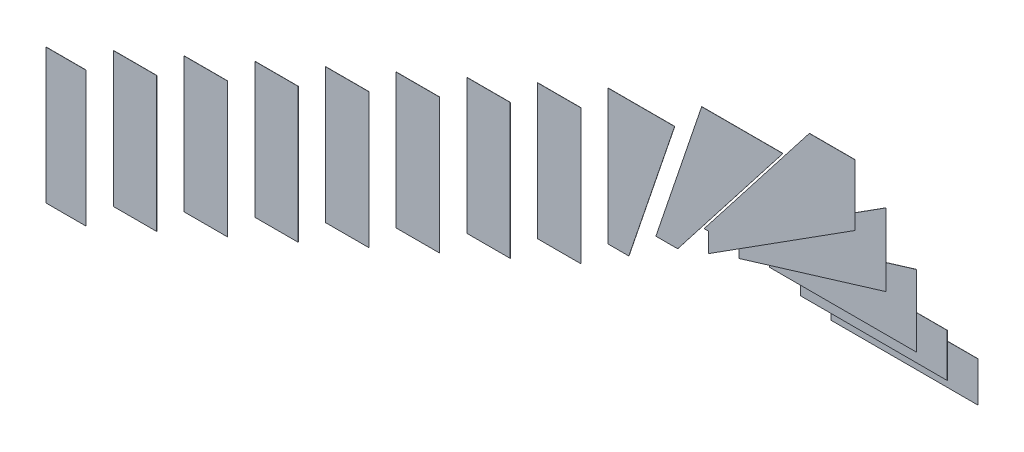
ISO-10303-21;
HEADER;
FILE_DESCRIPTION(('STEP AP214'),'2;1');
FILE_NAME('part.step','',(''),(''),'','','');
FILE_SCHEMA(('AUTOMOTIVE_DESIGN { 1 0 10303 214 1 1 1 1 }'));
ENDSEC;
DATA;
#1=APPLICATION_CONTEXT('core data for automotive mechanical design processes');
#2=APPLICATION_PROTOCOL_DEFINITION('international standard','automotive_design',2000,#1);
#3=PRODUCT_CONTEXT('',#1,'mechanical');
#4=PRODUCT('Part','Part','',(#3));
#5=PRODUCT_RELATED_PRODUCT_CATEGORY('part','',(#4));
#6=PRODUCT_DEFINITION_FORMATION('','',#4);
#7=PRODUCT_DEFINITION_CONTEXT('part definition',#1,'design');
#8=PRODUCT_DEFINITION('design','',#6,#7);
#9=PRODUCT_DEFINITION_SHAPE('','',#8);
#10=(LENGTH_UNIT() NAMED_UNIT(*) SI_UNIT(.MILLI.,.METRE.));
#11=(NAMED_UNIT(*) PLANE_ANGLE_UNIT() SI_UNIT($,.RADIAN.));
#12=(NAMED_UNIT(*) SI_UNIT($,.STERADIAN.) SOLID_ANGLE_UNIT());
#13=UNCERTAINTY_MEASURE_WITH_UNIT(LENGTH_MEASURE(1.E-05),#10,'distance_accuracy_value','');
#14=(GEOMETRIC_REPRESENTATION_CONTEXT(3) GLOBAL_UNCERTAINTY_ASSIGNED_CONTEXT((#13)) GLOBAL_UNIT_ASSIGNED_CONTEXT((#10,
#11,#12)) REPRESENTATION_CONTEXT('',''));
#15=CARTESIAN_POINT('',(0.,0.,0.));
#16=DIRECTION('',(0.,0.,1.));
#17=DIRECTION('',(1.,0.,0.));
#18=AXIS2_PLACEMENT_3D('',#15,#16,#17);
#19=CARTESIAN_POINT('',(0.,0.,2721.937014));
#20=DIRECTION('',(0.,0.,-1.));
#21=DIRECTION('',(-1.,0.,0.));
#22=AXIS2_PLACEMENT_3D('',#19,#20,#21);
#23=PLANE('',#22);
#24=DIRECTION('',(0.,1.,0.));
#25=VECTOR('',#24,1.);
#26=CARTESIAN_POINT('',(10.,-819.999993,2721.937014));
#27=LINE('',#26,#25);
#28=CARTESIAN_POINT('',(10.,-819.999993,2721.937014));
#29=VERTEX_POINT('',#28);
#30=CARTESIAN_POINT('',(10.,-10.,2721.937014));
#31=VERTEX_POINT('',#30);
#32=EDGE_CURVE('E93',#29,#31,#27,.T.);
#33=ORIENTED_EDGE('',*,*,#32,.F.);
#34=DIRECTION('',(-1.,0.,0.));
#35=VECTOR('',#34,1.);
#36=CARTESIAN_POINT('',(250.,-819.999993,2721.937014));
#37=LINE('',#36,#35);
#38=CARTESIAN_POINT('',(250.,-819.999993,2721.937014));
#39=VERTEX_POINT('',#38);
#40=EDGE_CURVE('E101',#39,#29,#37,.T.);
#41=ORIENTED_EDGE('',*,*,#40,.F.);
#42=DIRECTION('',(0.,-1.,0.));
#43=VECTOR('',#42,1.);
#44=CARTESIAN_POINT('',(250.,-10.,2721.937014));
#45=LINE('',#44,#43);
#46=CARTESIAN_POINT('',(250.,-10.,2721.937014));
#47=VERTEX_POINT('',#46);
#48=EDGE_CURVE('E108',#47,#39,#45,.T.);
#49=ORIENTED_EDGE('',*,*,#48,.F.);
#50=DIRECTION('',(1.,0.,0.));
#51=VECTOR('',#50,1.);
#52=CARTESIAN_POINT('',(10.,-10.,2721.937014));
#53=LINE('',#52,#51);
#54=EDGE_CURVE('E72',#31,#47,#53,.T.);
#55=ORIENTED_EDGE('',*,*,#54,.F.);
#56=EDGE_LOOP('',(#33,#41,#49,#55));
#57=FACE_BOUND('',#56,.T.);
#58=ADVANCED_FACE('F63',(#57),#23,.F.);
#59=CARTESIAN_POINT('',(0.,0.,2720.937014));
#60=DIRECTION('',(0.,0.,-1.));
#61=DIRECTION('',(-1.,0.,0.));
#62=AXIS2_PLACEMENT_3D('',#59,#60,#61);
#63=PLANE('',#62);
#64=DIRECTION('',(0.,1.,0.));
#65=VECTOR('',#64,1.);
#66=CARTESIAN_POINT('',(10.,-819.999993,2720.937014));
#67=LINE('',#66,#65);
#68=CARTESIAN_POINT('',(10.,-819.999993,2720.937014));
#69=VERTEX_POINT('',#68);
#70=CARTESIAN_POINT('',(10.,-10.,2720.937014));
#71=VERTEX_POINT('',#70);
#72=EDGE_CURVE('E150',#69,#71,#67,.T.);
#73=ORIENTED_EDGE('',*,*,#72,.T.);
#74=DIRECTION('',(1.,0.,0.));
#75=VECTOR('',#74,1.);
#76=CARTESIAN_POINT('',(10.,-10.,2720.937014));
#77=LINE('',#76,#75);
#78=CARTESIAN_POINT('',(250.,-10.,2720.937014));
#79=VERTEX_POINT('',#78);
#80=EDGE_CURVE('E13',#71,#79,#77,.T.);
#81=ORIENTED_EDGE('',*,*,#80,.T.);
#82=DIRECTION('',(0.,-1.,0.));
#83=VECTOR('',#82,1.);
#84=CARTESIAN_POINT('',(250.,-10.,2720.937014));
#85=LINE('',#84,#83);
#86=CARTESIAN_POINT('',(250.,-819.999993,2720.937014));
#87=VERTEX_POINT('',#86);
#88=EDGE_CURVE('E123',#79,#87,#85,.T.);
#89=ORIENTED_EDGE('',*,*,#88,.T.);
#90=DIRECTION('',(-1.,0.,0.));
#91=VECTOR('',#90,1.);
#92=CARTESIAN_POINT('',(250.,-819.999993,2720.937014));
#93=LINE('',#92,#91);
#94=EDGE_CURVE('E114',#87,#69,#93,.T.);
#95=ORIENTED_EDGE('',*,*,#94,.T.);
#96=EDGE_LOOP('',(#73,#81,#89,#95));
#97=FACE_BOUND('',#96,.T.);
#98=ADVANCED_FACE('F125',(#97),#63,.T.);
#99=CARTESIAN_POINT('',(10.,-819.999993,2720.937014));
#100=DIRECTION('',(1.,0.,0.));
#101=DIRECTION('',(0.,0.,-1.));
#102=AXIS2_PLACEMENT_3D('',#99,#100,#101);
#103=PLANE('',#102);
#104=ORIENTED_EDGE('',*,*,#32,.T.);
#105=DIRECTION('',(0.,0.,1.));
#106=VECTOR('',#105,1.);
#107=CARTESIAN_POINT('',(10.,-10.,2720.937014));
#108=LINE('',#107,#106);
#109=EDGE_CURVE('E148',#71,#31,#108,.T.);
#110=ORIENTED_EDGE('',*,*,#109,.F.);
#111=ORIENTED_EDGE('',*,*,#72,.F.);
#112=DIRECTION('',(0.,0.,1.));
#113=VECTOR('',#112,1.);
#114=CARTESIAN_POINT('',(10.,-819.999993,2720.937014));
#115=LINE('',#114,#113);
#116=EDGE_CURVE('E117',#69,#29,#115,.T.);
#117=ORIENTED_EDGE('',*,*,#116,.T.);
#118=EDGE_LOOP('',(#104,#110,#111,#117));
#119=FACE_BOUND('',#118,.T.);
#120=ADVANCED_FACE('F165',(#119),#103,.F.);
#121=CARTESIAN_POINT('',(250.,-819.999993,2720.937014));
#122=DIRECTION('',(0.,1.,0.));
#123=DIRECTION('',(0.,0.,1.));
#124=AXIS2_PLACEMENT_3D('',#121,#122,#123);
#125=PLANE('',#124);
#126=ORIENTED_EDGE('',*,*,#40,.T.);
#127=ORIENTED_EDGE('',*,*,#116,.F.);
#128=ORIENTED_EDGE('',*,*,#94,.F.);
#129=DIRECTION('',(0.,0.,1.));
#130=VECTOR('',#129,1.);
#131=CARTESIAN_POINT('',(250.,-819.999993,2720.937014));
#132=LINE('',#131,#130);
#133=EDGE_CURVE('E116',#87,#39,#132,.T.);
#134=ORIENTED_EDGE('',*,*,#133,.T.);
#135=EDGE_LOOP('',(#126,#127,#128,#134));
#136=FACE_BOUND('',#135,.T.);
#137=ADVANCED_FACE('F115',(#136),#125,.F.);
#138=CARTESIAN_POINT('',(250.,-10.,2720.937014));
#139=DIRECTION('',(-1.,0.,0.));
#140=DIRECTION('',(0.,0.,1.));
#141=AXIS2_PLACEMENT_3D('',#138,#139,#140);
#142=PLANE('',#141);
#143=ORIENTED_EDGE('',*,*,#48,.T.);
#144=ORIENTED_EDGE('',*,*,#133,.F.);
#145=ORIENTED_EDGE('',*,*,#88,.F.);
#146=DIRECTION('',(0.,0.,1.));
#147=VECTOR('',#146,1.);
#148=CARTESIAN_POINT('',(250.,-10.,2720.937014));
#149=LINE('',#148,#147);
#150=EDGE_CURVE('E126',#79,#47,#149,.T.);
#151=ORIENTED_EDGE('',*,*,#150,.T.);
#152=EDGE_LOOP('',(#143,#144,#145,#151));
#153=FACE_BOUND('',#152,.T.);
#154=ADVANCED_FACE('F122',(#153),#142,.F.);
#155=CARTESIAN_POINT('',(10.,-10.,2720.937014));
#156=DIRECTION('',(0.,-1.,0.));
#157=DIRECTION('',(0.,0.,-1.));
#158=AXIS2_PLACEMENT_3D('',#155,#156,#157);
#159=PLANE('',#158);
#160=ORIENTED_EDGE('',*,*,#54,.T.);
#161=ORIENTED_EDGE('',*,*,#150,.F.);
#162=ORIENTED_EDGE('',*,*,#80,.F.);
#163=ORIENTED_EDGE('',*,*,#109,.T.);
#164=EDGE_LOOP('',(#160,#161,#162,#163));
#165=FACE_BOUND('',#164,.T.);
#166=ADVANCED_FACE('F159',(#165),#159,.F.);
#167=CLOSED_SHELL('',(#58,#98,#120,#137,#154,#166));
#168=MANIFOLD_SOLID_BREP('B2',#167);
#169=CARTESIAN_POINT('',(0.,0.,2537.870003));
#170=DIRECTION('',(0.,0.,-1.));
#171=DIRECTION('',(-1.,0.,0.));
#172=AXIS2_PLACEMENT_3D('',#169,#170,#171);
#173=PLANE('',#172);
#174=DIRECTION('',(0.,1.,0.));
#175=VECTOR('',#174,1.);
#176=CARTESIAN_POINT('',(230.000004,-819.999993,2537.870003));
#177=LINE('',#176,#175);
#178=CARTESIAN_POINT('',(230.000004,-819.999993,2537.870003));
#179=VERTEX_POINT('',#178);
#180=CARTESIAN_POINT('',(230.000004,-10.,2537.870003));
#181=VERTEX_POINT('',#180);
#182=EDGE_CURVE('E251',#179,#181,#177,.T.);
#183=ORIENTED_EDGE('',*,*,#182,.F.);
#184=DIRECTION('',(-1.,0.,0.));
#185=VECTOR('',#184,1.);
#186=CARTESIAN_POINT('',(490.00001,-819.999993,2537.870003));
#187=LINE('',#186,#185);
#188=CARTESIAN_POINT('',(490.00001,-819.999993,2537.870003));
#189=VERTEX_POINT('',#188);
#190=EDGE_CURVE('E259',#189,#179,#187,.T.);
#191=ORIENTED_EDGE('',*,*,#190,.F.);
#192=DIRECTION('',(0.,-1.,0.));
#193=VECTOR('',#192,1.);
#194=CARTESIAN_POINT('',(490.00001,-10.,2537.870003));
#195=LINE('',#194,#193);
#196=CARTESIAN_POINT('',(490.00001,-10.,2537.870003));
#197=VERTEX_POINT('',#196);
#198=EDGE_CURVE('E266',#197,#189,#195,.T.);
#199=ORIENTED_EDGE('',*,*,#198,.F.);
#200=DIRECTION('',(1.,0.,0.));
#201=VECTOR('',#200,1.);
#202=CARTESIAN_POINT('',(230.000004,-10.,2537.870003));
#203=LINE('',#202,#201);
#204=EDGE_CURVE('E230',#181,#197,#203,.T.);
#205=ORIENTED_EDGE('',*,*,#204,.F.);
#206=EDGE_LOOP('',(#183,#191,#199,#205));
#207=FACE_BOUND('',#206,.T.);
#208=ADVANCED_FACE('F221',(#207),#173,.F.);
#209=CARTESIAN_POINT('',(0.,0.,2536.870003));
#210=DIRECTION('',(0.,0.,-1.));
#211=DIRECTION('',(-1.,0.,0.));
#212=AXIS2_PLACEMENT_3D('',#209,#210,#211);
#213=PLANE('',#212);
#214=DIRECTION('',(0.,1.,0.));
#215=VECTOR('',#214,1.);
#216=CARTESIAN_POINT('',(230.000004,-819.999993,2536.870003));
#217=LINE('',#216,#215);
#218=CARTESIAN_POINT('',(230.000004,-819.999993,2536.870003));
#219=VERTEX_POINT('',#218);
#220=CARTESIAN_POINT('',(230.000004,-10.,2536.870003));
#221=VERTEX_POINT('',#220);
#222=EDGE_CURVE('E308',#219,#221,#217,.T.);
#223=ORIENTED_EDGE('',*,*,#222,.T.);
#224=DIRECTION('',(1.,0.,0.));
#225=VECTOR('',#224,1.);
#226=CARTESIAN_POINT('',(230.000004,-10.,2536.870003));
#227=LINE('',#226,#225);
#228=CARTESIAN_POINT('',(490.00001,-10.,2536.870003));
#229=VERTEX_POINT('',#228);
#230=EDGE_CURVE('E61',#221,#229,#227,.T.);
#231=ORIENTED_EDGE('',*,*,#230,.T.);
#232=DIRECTION('',(0.,-1.,0.));
#233=VECTOR('',#232,1.);
#234=CARTESIAN_POINT('',(490.00001,-10.,2536.870003));
#235=LINE('',#234,#233);
#236=CARTESIAN_POINT('',(490.00001,-819.999993,2536.870003));
#237=VERTEX_POINT('',#236);
#238=EDGE_CURVE('E281',#229,#237,#235,.T.);
#239=ORIENTED_EDGE('',*,*,#238,.T.);
#240=DIRECTION('',(-1.,0.,0.));
#241=VECTOR('',#240,1.);
#242=CARTESIAN_POINT('',(490.00001,-819.999993,2536.870003));
#243=LINE('',#242,#241);
#244=EDGE_CURVE('E272',#237,#219,#243,.T.);
#245=ORIENTED_EDGE('',*,*,#244,.T.);
#246=EDGE_LOOP('',(#223,#231,#239,#245));
#247=FACE_BOUND('',#246,.T.);
#248=ADVANCED_FACE('F283',(#247),#213,.T.);
#249=CARTESIAN_POINT('',(230.000004,-819.999993,2536.870003));
#250=DIRECTION('',(1.,0.,0.));
#251=DIRECTION('',(0.,0.,-1.));
#252=AXIS2_PLACEMENT_3D('',#249,#250,#251);
#253=PLANE('',#252);
#254=ORIENTED_EDGE('',*,*,#182,.T.);
#255=DIRECTION('',(0.,0.,1.));
#256=VECTOR('',#255,1.);
#257=CARTESIAN_POINT('',(230.000004,-10.,2536.870003));
#258=LINE('',#257,#256);
#259=EDGE_CURVE('E306',#221,#181,#258,.T.);
#260=ORIENTED_EDGE('',*,*,#259,.F.);
#261=ORIENTED_EDGE('',*,*,#222,.F.);
#262=DIRECTION('',(0.,0.,1.));
#263=VECTOR('',#262,1.);
#264=CARTESIAN_POINT('',(230.000004,-819.999993,2536.870003));
#265=LINE('',#264,#263);
#266=EDGE_CURVE('E275',#219,#179,#265,.T.);
#267=ORIENTED_EDGE('',*,*,#266,.T.);
#268=EDGE_LOOP('',(#254,#260,#261,#267));
#269=FACE_BOUND('',#268,.T.);
#270=ADVANCED_FACE('F323',(#269),#253,.F.);
#271=CARTESIAN_POINT('',(490.00001,-819.999993,2536.870003));
#272=DIRECTION('',(0.,1.,0.));
#273=DIRECTION('',(0.,0.,1.));
#274=AXIS2_PLACEMENT_3D('',#271,#272,#273);
#275=PLANE('',#274);
#276=ORIENTED_EDGE('',*,*,#190,.T.);
#277=ORIENTED_EDGE('',*,*,#266,.F.);
#278=ORIENTED_EDGE('',*,*,#244,.F.);
#279=DIRECTION('',(0.,0.,1.));
#280=VECTOR('',#279,1.);
#281=CARTESIAN_POINT('',(490.00001,-819.999993,2536.870003));
#282=LINE('',#281,#280);
#283=EDGE_CURVE('E274',#237,#189,#282,.T.);
#284=ORIENTED_EDGE('',*,*,#283,.T.);
#285=EDGE_LOOP('',(#276,#277,#278,#284));
#286=FACE_BOUND('',#285,.T.);
#287=ADVANCED_FACE('F273',(#286),#275,.F.);
#288=CARTESIAN_POINT('',(490.00001,-10.,2536.870003));
#289=DIRECTION('',(-1.,0.,0.));
#290=DIRECTION('',(0.,0.,1.));
#291=AXIS2_PLACEMENT_3D('',#288,#289,#290);
#292=PLANE('',#291);
#293=ORIENTED_EDGE('',*,*,#198,.T.);
#294=ORIENTED_EDGE('',*,*,#283,.F.);
#295=ORIENTED_EDGE('',*,*,#238,.F.);
#296=DIRECTION('',(0.,0.,1.));
#297=VECTOR('',#296,1.);
#298=CARTESIAN_POINT('',(490.00001,-10.,2536.870003));
#299=LINE('',#298,#297);
#300=EDGE_CURVE('E284',#229,#197,#299,.T.);
#301=ORIENTED_EDGE('',*,*,#300,.T.);
#302=EDGE_LOOP('',(#293,#294,#295,#301));
#303=FACE_BOUND('',#302,.T.);
#304=ADVANCED_FACE('F280',(#303),#292,.F.);
#305=CARTESIAN_POINT('',(230.000004,-10.,2536.870003));
#306=DIRECTION('',(0.,-1.,0.));
#307=DIRECTION('',(0.,0.,-1.));
#308=AXIS2_PLACEMENT_3D('',#305,#306,#307);
#309=PLANE('',#308);
#310=ORIENTED_EDGE('',*,*,#204,.T.);
#311=ORIENTED_EDGE('',*,*,#300,.F.);
#312=ORIENTED_EDGE('',*,*,#230,.F.);
#313=ORIENTED_EDGE('',*,*,#259,.T.);
#314=EDGE_LOOP('',(#310,#311,#312,#313));
#315=FACE_BOUND('',#314,.T.);
#316=ADVANCED_FACE('F317',(#315),#309,.F.);
#317=CLOSED_SHELL('',(#208,#248,#270,#287,#304,#316));
#318=MANIFOLD_SOLID_BREP('B7',#317);
#319=CARTESIAN_POINT('',(0.,0.,2353.810144));
#320=DIRECTION('',(0.,0.,-1.));
#321=DIRECTION('',(-1.,0.,0.));
#322=AXIS2_PLACEMENT_3D('',#319,#320,#321);
#323=PLANE('',#322);
#324=DIRECTION('',(0.,1.,0.));
#325=VECTOR('',#324,1.);
#326=CARTESIAN_POINT('',(469.999999,-819.999993,2353.810144));
#327=LINE('',#326,#325);
#328=CARTESIAN_POINT('',(469.999999,-819.999993,2353.810144));
#329=VERTEX_POINT('',#328);
#330=CARTESIAN_POINT('',(469.999999,-10.,2353.810144));
#331=VERTEX_POINT('',#330);
#332=EDGE_CURVE('E409',#329,#331,#327,.T.);
#333=ORIENTED_EDGE('',*,*,#332,.F.);
#334=DIRECTION('',(-1.,0.,0.));
#335=VECTOR('',#334,1.);
#336=CARTESIAN_POINT('',(730.000019,-819.999993,2353.810144));
#337=LINE('',#336,#335);
#338=CARTESIAN_POINT('',(730.000019,-819.999993,2353.810144));
#339=VERTEX_POINT('',#338);
#340=EDGE_CURVE('E417',#339,#329,#337,.T.);
#341=ORIENTED_EDGE('',*,*,#340,.F.);
#342=DIRECTION('',(0.,-1.,0.));
#343=VECTOR('',#342,1.);
#344=CARTESIAN_POINT('',(730.000019,-10.,2353.810144));
#345=LINE('',#344,#343);
#346=CARTESIAN_POINT('',(730.000019,-10.,2353.810144));
#347=VERTEX_POINT('',#346);
#348=EDGE_CURVE('E424',#347,#339,#345,.T.);
#349=ORIENTED_EDGE('',*,*,#348,.F.);
#350=DIRECTION('',(1.,0.,0.));
#351=VECTOR('',#350,1.);
#352=CARTESIAN_POINT('',(469.999999,-10.,2353.810144));
#353=LINE('',#352,#351);
#354=EDGE_CURVE('E388',#331,#347,#353,.T.);
#355=ORIENTED_EDGE('',*,*,#354,.F.);
#356=EDGE_LOOP('',(#333,#341,#349,#355));
#357=FACE_BOUND('',#356,.T.);
#358=ADVANCED_FACE('F379',(#357),#323,.F.);
#359=CARTESIAN_POINT('',(0.,0.,2352.810144));
#360=DIRECTION('',(0.,0.,-1.));
#361=DIRECTION('',(-1.,0.,0.));
#362=AXIS2_PLACEMENT_3D('',#359,#360,#361);
#363=PLANE('',#362);
#364=DIRECTION('',(0.,1.,0.));
#365=VECTOR('',#364,1.);
#366=CARTESIAN_POINT('',(469.999999,-819.999993,2352.810144));
#367=LINE('',#366,#365);
#368=CARTESIAN_POINT('',(469.999999,-819.999993,2352.810144));
#369=VERTEX_POINT('',#368);
#370=CARTESIAN_POINT('',(469.999999,-10.,2352.810144));
#371=VERTEX_POINT('',#370);
#372=EDGE_CURVE('E466',#369,#371,#367,.T.);
#373=ORIENTED_EDGE('',*,*,#372,.T.);
#374=DIRECTION('',(1.,0.,0.));
#375=VECTOR('',#374,1.);
#376=CARTESIAN_POINT('',(469.999999,-10.,2352.810144));
#377=LINE('',#376,#375);
#378=CARTESIAN_POINT('',(730.000019,-10.,2352.810144));
#379=VERTEX_POINT('',#378);
#380=EDGE_CURVE('E219',#371,#379,#377,.T.);
#381=ORIENTED_EDGE('',*,*,#380,.T.);
#382=DIRECTION('',(0.,-1.,0.));
#383=VECTOR('',#382,1.);
#384=CARTESIAN_POINT('',(730.000019,-10.,2352.810144));
#385=LINE('',#384,#383);
#386=CARTESIAN_POINT('',(730.000019,-819.999993,2352.810144));
#387=VERTEX_POINT('',#386);
#388=EDGE_CURVE('E439',#379,#387,#385,.T.);
#389=ORIENTED_EDGE('',*,*,#388,.T.);
#390=DIRECTION('',(-1.,0.,0.));
#391=VECTOR('',#390,1.);
#392=CARTESIAN_POINT('',(730.000019,-819.999993,2352.810144));
#393=LINE('',#392,#391);
#394=EDGE_CURVE('E430',#387,#369,#393,.T.);
#395=ORIENTED_EDGE('',*,*,#394,.T.);
#396=EDGE_LOOP('',(#373,#381,#389,#395));
#397=FACE_BOUND('',#396,.T.);
#398=ADVANCED_FACE('F441',(#397),#363,.T.);
#399=CARTESIAN_POINT('',(469.999999,-819.999993,2352.810144));
#400=DIRECTION('',(1.,0.,0.));
#401=DIRECTION('',(0.,0.,-1.));
#402=AXIS2_PLACEMENT_3D('',#399,#400,#401);
#403=PLANE('',#402);
#404=ORIENTED_EDGE('',*,*,#332,.T.);
#405=DIRECTION('',(0.,0.,1.));
#406=VECTOR('',#405,1.);
#407=CARTESIAN_POINT('',(469.999999,-10.,2352.810144));
#408=LINE('',#407,#406);
#409=EDGE_CURVE('E464',#371,#331,#408,.T.);
#410=ORIENTED_EDGE('',*,*,#409,.F.);
#411=ORIENTED_EDGE('',*,*,#372,.F.);
#412=DIRECTION('',(0.,0.,1.));
#413=VECTOR('',#412,1.);
#414=CARTESIAN_POINT('',(469.999999,-819.999993,2352.810144));
#415=LINE('',#414,#413);
#416=EDGE_CURVE('E433',#369,#329,#415,.T.);
#417=ORIENTED_EDGE('',*,*,#416,.T.);
#418=EDGE_LOOP('',(#404,#410,#411,#417));
#419=FACE_BOUND('',#418,.T.);
#420=ADVANCED_FACE('F481',(#419),#403,.F.);
#421=CARTESIAN_POINT('',(730.000019,-819.999993,2352.810144));
#422=DIRECTION('',(0.,1.,0.));
#423=DIRECTION('',(0.,0.,1.));
#424=AXIS2_PLACEMENT_3D('',#421,#422,#423);
#425=PLANE('',#424);
#426=ORIENTED_EDGE('',*,*,#340,.T.);
#427=ORIENTED_EDGE('',*,*,#416,.F.);
#428=ORIENTED_EDGE('',*,*,#394,.F.);
#429=DIRECTION('',(0.,0.,1.));
#430=VECTOR('',#429,1.);
#431=CARTESIAN_POINT('',(730.000019,-819.999993,2352.810144));
#432=LINE('',#431,#430);
#433=EDGE_CURVE('E432',#387,#339,#432,.T.);
#434=ORIENTED_EDGE('',*,*,#433,.T.);
#435=EDGE_LOOP('',(#426,#427,#428,#434));
#436=FACE_BOUND('',#435,.T.);
#437=ADVANCED_FACE('F431',(#436),#425,.F.);
#438=CARTESIAN_POINT('',(730.000019,-10.,2352.810144));
#439=DIRECTION('',(-1.,0.,0.));
#440=DIRECTION('',(0.,0.,1.));
#441=AXIS2_PLACEMENT_3D('',#438,#439,#440);
#442=PLANE('',#441);
#443=ORIENTED_EDGE('',*,*,#348,.T.);
#444=ORIENTED_EDGE('',*,*,#433,.F.);
#445=ORIENTED_EDGE('',*,*,#388,.F.);
#446=DIRECTION('',(0.,0.,1.));
#447=VECTOR('',#446,1.);
#448=CARTESIAN_POINT('',(730.000019,-10.,2352.810144));
#449=LINE('',#448,#447);
#450=EDGE_CURVE('E442',#379,#347,#449,.T.);
#451=ORIENTED_EDGE('',*,*,#450,.T.);
#452=EDGE_LOOP('',(#443,#444,#445,#451));
#453=FACE_BOUND('',#452,.T.);
#454=ADVANCED_FACE('F438',(#453),#442,.F.);
#455=CARTESIAN_POINT('',(469.999999,-10.,2352.810144));
#456=DIRECTION('',(0.,-1.,0.));
#457=DIRECTION('',(0.,0.,-1.));
#458=AXIS2_PLACEMENT_3D('',#455,#456,#457);
#459=PLANE('',#458);
#460=ORIENTED_EDGE('',*,*,#354,.T.);
#461=ORIENTED_EDGE('',*,*,#450,.F.);
#462=ORIENTED_EDGE('',*,*,#380,.F.);
#463=ORIENTED_EDGE('',*,*,#409,.T.);
#464=EDGE_LOOP('',(#460,#461,#462,#463));
#465=FACE_BOUND('',#464,.T.);
#466=ADVANCED_FACE('F475',(#465),#459,.F.);
#467=CLOSED_SHELL('',(#358,#398,#420,#437,#454,#466));
#468=MANIFOLD_SOLID_BREP('B55',#467);
#469=CARTESIAN_POINT('',(0.,0.,2169.750048));
#470=DIRECTION('',(0.,0.,-1.));
#471=DIRECTION('',(-1.,0.,0.));
#472=AXIS2_PLACEMENT_3D('',#469,#470,#471);
#473=PLANE('',#472);
#474=DIRECTION('',(0.,1.,0.));
#475=VECTOR('',#474,1.);
#476=CARTESIAN_POINT('',(709.999979,-819.999993,2169.750048));
#477=LINE('',#476,#475);
#478=CARTESIAN_POINT('',(709.999979,-819.999993,2169.750048));
#479=VERTEX_POINT('',#478);
#480=CARTESIAN_POINT('',(709.999979,-10.,2169.750048));
#481=VERTEX_POINT('',#480);
#482=EDGE_CURVE('E567',#479,#481,#477,.T.);
#483=ORIENTED_EDGE('',*,*,#482,.F.);
#484=DIRECTION('',(-1.,0.,0.));
#485=VECTOR('',#484,1.);
#486=CARTESIAN_POINT('',(970.000029,-819.999993,2169.750048));
#487=LINE('',#486,#485);
#488=CARTESIAN_POINT('',(970.000029,-819.999993,2169.750048));
#489=VERTEX_POINT('',#488);
#490=EDGE_CURVE('E575',#489,#479,#487,.T.);
#491=ORIENTED_EDGE('',*,*,#490,.F.);
#492=DIRECTION('',(0.,-1.,0.));
#493=VECTOR('',#492,1.);
#494=CARTESIAN_POINT('',(970.000029,-10.,2169.750048));
#495=LINE('',#494,#493);
#496=CARTESIAN_POINT('',(970.000029,-10.,2169.750048));
#497=VERTEX_POINT('',#496);
#498=EDGE_CURVE('E582',#497,#489,#495,.T.);
#499=ORIENTED_EDGE('',*,*,#498,.F.);
#500=DIRECTION('',(1.,0.,0.));
#501=VECTOR('',#500,1.);
#502=CARTESIAN_POINT('',(709.999979,-10.,2169.750048));
#503=LINE('',#502,#501);
#504=EDGE_CURVE('E546',#481,#497,#503,.T.);
#505=ORIENTED_EDGE('',*,*,#504,.F.);
#506=EDGE_LOOP('',(#483,#491,#499,#505));
#507=FACE_BOUND('',#506,.T.);
#508=ADVANCED_FACE('F537',(#507),#473,.F.);
#509=CARTESIAN_POINT('',(0.,0.,2168.750048));
#510=DIRECTION('',(0.,0.,-1.));
#511=DIRECTION('',(-1.,0.,0.));
#512=AXIS2_PLACEMENT_3D('',#509,#510,#511);
#513=PLANE('',#512);
#514=DIRECTION('',(0.,1.,0.));
#515=VECTOR('',#514,1.);
#516=CARTESIAN_POINT('',(709.999979,-819.999993,2168.750048));
#517=LINE('',#516,#515);
#518=CARTESIAN_POINT('',(709.999979,-819.999993,2168.750048));
#519=VERTEX_POINT('',#518);
#520=CARTESIAN_POINT('',(709.999979,-10.,2168.750048));
#521=VERTEX_POINT('',#520);
#522=EDGE_CURVE('E624',#519,#521,#517,.T.);
#523=ORIENTED_EDGE('',*,*,#522,.T.);
#524=DIRECTION('',(1.,0.,0.));
#525=VECTOR('',#524,1.);
#526=CARTESIAN_POINT('',(709.999979,-10.,2168.750048));
#527=LINE('',#526,#525);
#528=CARTESIAN_POINT('',(970.000029,-10.,2168.750048));
#529=VERTEX_POINT('',#528);
#530=EDGE_CURVE('E377',#521,#529,#527,.T.);
#531=ORIENTED_EDGE('',*,*,#530,.T.);
#532=DIRECTION('',(0.,-1.,0.));
#533=VECTOR('',#532,1.);
#534=CARTESIAN_POINT('',(970.000029,-10.,2168.750048));
#535=LINE('',#534,#533);
#536=CARTESIAN_POINT('',(970.000029,-819.999993,2168.750048));
#537=VERTEX_POINT('',#536);
#538=EDGE_CURVE('E597',#529,#537,#535,.T.);
#539=ORIENTED_EDGE('',*,*,#538,.T.);
#540=DIRECTION('',(-1.,0.,0.));
#541=VECTOR('',#540,1.);
#542=CARTESIAN_POINT('',(970.000029,-819.999993,2168.750048));
#543=LINE('',#542,#541);
#544=EDGE_CURVE('E588',#537,#519,#543,.T.);
#545=ORIENTED_EDGE('',*,*,#544,.T.);
#546=EDGE_LOOP('',(#523,#531,#539,#545));
#547=FACE_BOUND('',#546,.T.);
#548=ADVANCED_FACE('F599',(#547),#513,.T.);
#549=CARTESIAN_POINT('',(709.999979,-819.999993,2168.750048));
#550=DIRECTION('',(1.,0.,0.));
#551=DIRECTION('',(0.,0.,-1.));
#552=AXIS2_PLACEMENT_3D('',#549,#550,#551);
#553=PLANE('',#552);
#554=ORIENTED_EDGE('',*,*,#482,.T.);
#555=DIRECTION('',(0.,0.,1.));
#556=VECTOR('',#555,1.);
#557=CARTESIAN_POINT('',(709.999979,-10.,2168.750048));
#558=LINE('',#557,#556);
#559=EDGE_CURVE('E622',#521,#481,#558,.T.);
#560=ORIENTED_EDGE('',*,*,#559,.F.);
#561=ORIENTED_EDGE('',*,*,#522,.F.);
#562=DIRECTION('',(0.,0.,1.));
#563=VECTOR('',#562,1.);
#564=CARTESIAN_POINT('',(709.999979,-819.999993,2168.750048));
#565=LINE('',#564,#563);
#566=EDGE_CURVE('E591',#519,#479,#565,.T.);
#567=ORIENTED_EDGE('',*,*,#566,.T.);
#568=EDGE_LOOP('',(#554,#560,#561,#567));
#569=FACE_BOUND('',#568,.T.);
#570=ADVANCED_FACE('F639',(#569),#553,.F.);
#571=CARTESIAN_POINT('',(970.000029,-819.999993,2168.750048));
#572=DIRECTION('',(0.,1.,0.));
#573=DIRECTION('',(0.,0.,1.));
#574=AXIS2_PLACEMENT_3D('',#571,#572,#573);
#575=PLANE('',#574);
#576=ORIENTED_EDGE('',*,*,#490,.T.);
#577=ORIENTED_EDGE('',*,*,#566,.F.);
#578=ORIENTED_EDGE('',*,*,#544,.F.);
#579=DIRECTION('',(0.,0.,1.));
#580=VECTOR('',#579,1.);
#581=CARTESIAN_POINT('',(970.000029,-819.999993,2168.750048));
#582=LINE('',#581,#580);
#583=EDGE_CURVE('E590',#537,#489,#582,.T.);
#584=ORIENTED_EDGE('',*,*,#583,.T.);
#585=EDGE_LOOP('',(#576,#577,#578,#584));
#586=FACE_BOUND('',#585,.T.);
#587=ADVANCED_FACE('F589',(#586),#575,.F.);
#588=CARTESIAN_POINT('',(970.000029,-10.,2168.750048));
#589=DIRECTION('',(-1.,0.,0.));
#590=DIRECTION('',(0.,0.,1.));
#591=AXIS2_PLACEMENT_3D('',#588,#589,#590);
#592=PLANE('',#591);
#593=ORIENTED_EDGE('',*,*,#498,.T.);
#594=ORIENTED_EDGE('',*,*,#583,.F.);
#595=ORIENTED_EDGE('',*,*,#538,.F.);
#596=DIRECTION('',(0.,0.,1.));
#597=VECTOR('',#596,1.);
#598=CARTESIAN_POINT('',(970.000029,-10.,2168.750048));
#599=LINE('',#598,#597);
#600=EDGE_CURVE('E600',#529,#497,#599,.T.);
#601=ORIENTED_EDGE('',*,*,#600,.T.);
#602=EDGE_LOOP('',(#593,#594,#595,#601));
#603=FACE_BOUND('',#602,.T.);
#604=ADVANCED_FACE('F596',(#603),#592,.F.);
#605=CARTESIAN_POINT('',(709.999979,-10.,2168.750048));
#606=DIRECTION('',(0.,-1.,0.));
#607=DIRECTION('',(0.,0.,-1.));
#608=AXIS2_PLACEMENT_3D('',#605,#606,#607);
#609=PLANE('',#608);
#610=ORIENTED_EDGE('',*,*,#504,.T.);
#611=ORIENTED_EDGE('',*,*,#600,.F.);
#612=ORIENTED_EDGE('',*,*,#530,.F.);
#613=ORIENTED_EDGE('',*,*,#559,.T.);
#614=EDGE_LOOP('',(#610,#611,#612,#613));
#615=FACE_BOUND('',#614,.T.);
#616=ADVANCED_FACE('F633',(#615),#609,.F.);
#617=CLOSED_SHELL('',(#508,#548,#570,#587,#604,#616));
#618=MANIFOLD_SOLID_BREP('B213',#617);
#619=CARTESIAN_POINT('',(0.,0.,1985.689713));
#620=DIRECTION('',(0.,0.,-1.));
#621=DIRECTION('',(-1.,0.,0.));
#622=AXIS2_PLACEMENT_3D('',#619,#620,#621);
#623=PLANE('',#622);
#624=DIRECTION('',(0.,1.,0.));
#625=VECTOR('',#624,1.);
#626=CARTESIAN_POINT('',(949.999988,-819.999993,1985.689713));
#627=LINE('',#626,#625);
#628=CARTESIAN_POINT('',(949.999988,-819.999993,1985.689713));
#629=VERTEX_POINT('',#628);
#630=CARTESIAN_POINT('',(949.999988,-10.,1985.689713));
#631=VERTEX_POINT('',#630);
#632=EDGE_CURVE('E725',#629,#631,#627,.T.);
#633=ORIENTED_EDGE('',*,*,#632,.F.);
#634=DIRECTION('',(-1.,0.,0.));
#635=VECTOR('',#634,1.);
#636=CARTESIAN_POINT('',(1210.000038,-819.999993,1985.689713));
#637=LINE('',#636,#635);
#638=CARTESIAN_POINT('',(1210.000038,-819.999993,1985.689713));
#639=VERTEX_POINT('',#638);
#640=EDGE_CURVE('E733',#639,#629,#637,.T.);
#641=ORIENTED_EDGE('',*,*,#640,.F.);
#642=DIRECTION('',(0.,-1.,0.));
#643=VECTOR('',#642,1.);
#644=CARTESIAN_POINT('',(1210.000038,-10.,1985.689713));
#645=LINE('',#644,#643);
#646=CARTESIAN_POINT('',(1210.000038,-10.,1985.689713));
#647=VERTEX_POINT('',#646);
#648=EDGE_CURVE('E740',#647,#639,#645,.T.);
#649=ORIENTED_EDGE('',*,*,#648,.F.);
#650=DIRECTION('',(1.,0.,0.));
#651=VECTOR('',#650,1.);
#652=CARTESIAN_POINT('',(949.999988,-10.,1985.689713));
#653=LINE('',#652,#651);
#654=EDGE_CURVE('E704',#631,#647,#653,.T.);
#655=ORIENTED_EDGE('',*,*,#654,.F.);
#656=EDGE_LOOP('',(#633,#641,#649,#655));
#657=FACE_BOUND('',#656,.T.);
#658=ADVANCED_FACE('F695',(#657),#623,.F.);
#659=CARTESIAN_POINT('',(0.,0.,1984.689713));
#660=DIRECTION('',(0.,0.,-1.));
#661=DIRECTION('',(-1.,0.,0.));
#662=AXIS2_PLACEMENT_3D('',#659,#660,#661);
#663=PLANE('',#662);
#664=DIRECTION('',(0.,1.,0.));
#665=VECTOR('',#664,1.);
#666=CARTESIAN_POINT('',(949.999988,-819.999993,1984.689713));
#667=LINE('',#666,#665);
#668=CARTESIAN_POINT('',(949.999988,-819.999993,1984.689713));
#669=VERTEX_POINT('',#668);
#670=CARTESIAN_POINT('',(949.999988,-10.,1984.689713));
#671=VERTEX_POINT('',#670);
#672=EDGE_CURVE('E782',#669,#671,#667,.T.);
#673=ORIENTED_EDGE('',*,*,#672,.T.);
#674=DIRECTION('',(1.,0.,0.));
#675=VECTOR('',#674,1.);
#676=CARTESIAN_POINT('',(949.999988,-10.,1984.689713));
#677=LINE('',#676,#675);
#678=CARTESIAN_POINT('',(1210.000038,-10.,1984.689713));
#679=VERTEX_POINT('',#678);
#680=EDGE_CURVE('E535',#671,#679,#677,.T.);
#681=ORIENTED_EDGE('',*,*,#680,.T.);
#682=DIRECTION('',(0.,-1.,0.));
#683=VECTOR('',#682,1.);
#684=CARTESIAN_POINT('',(1210.000038,-10.,1984.689713));
#685=LINE('',#684,#683);
#686=CARTESIAN_POINT('',(1210.000038,-819.999993,1984.689713));
#687=VERTEX_POINT('',#686);
#688=EDGE_CURVE('E755',#679,#687,#685,.T.);
#689=ORIENTED_EDGE('',*,*,#688,.T.);
#690=DIRECTION('',(-1.,0.,0.));
#691=VECTOR('',#690,1.);
#692=CARTESIAN_POINT('',(1210.000038,-819.999993,1984.689713));
#693=LINE('',#692,#691);
#694=EDGE_CURVE('E746',#687,#669,#693,.T.);
#695=ORIENTED_EDGE('',*,*,#694,.T.);
#696=EDGE_LOOP('',(#673,#681,#689,#695));
#697=FACE_BOUND('',#696,.T.);
#698=ADVANCED_FACE('F757',(#697),#663,.T.);
#699=CARTESIAN_POINT('',(949.999988,-819.999993,1984.689713));
#700=DIRECTION('',(1.,0.,0.));
#701=DIRECTION('',(0.,0.,-1.));
#702=AXIS2_PLACEMENT_3D('',#699,#700,#701);
#703=PLANE('',#702);
#704=ORIENTED_EDGE('',*,*,#632,.T.);
#705=DIRECTION('',(0.,0.,1.));
#706=VECTOR('',#705,1.);
#707=CARTESIAN_POINT('',(949.999988,-10.,1984.689713));
#708=LINE('',#707,#706);
#709=EDGE_CURVE('E780',#671,#631,#708,.T.);
#710=ORIENTED_EDGE('',*,*,#709,.F.);
#711=ORIENTED_EDGE('',*,*,#672,.F.);
#712=DIRECTION('',(0.,0.,1.));
#713=VECTOR('',#712,1.);
#714=CARTESIAN_POINT('',(949.999988,-819.999993,1984.689713));
#715=LINE('',#714,#713);
#716=EDGE_CURVE('E749',#669,#629,#715,.T.);
#717=ORIENTED_EDGE('',*,*,#716,.T.);
#718=EDGE_LOOP('',(#704,#710,#711,#717));
#719=FACE_BOUND('',#718,.T.);
#720=ADVANCED_FACE('F797',(#719),#703,.F.);
#721=CARTESIAN_POINT('',(1210.000038,-819.999993,1984.689713));
#722=DIRECTION('',(0.,1.,0.));
#723=DIRECTION('',(0.,0.,1.));
#724=AXIS2_PLACEMENT_3D('',#721,#722,#723);
#725=PLANE('',#724);
#726=ORIENTED_EDGE('',*,*,#640,.T.);
#727=ORIENTED_EDGE('',*,*,#716,.F.);
#728=ORIENTED_EDGE('',*,*,#694,.F.);
#729=DIRECTION('',(0.,0.,1.));
#730=VECTOR('',#729,1.);
#731=CARTESIAN_POINT('',(1210.000038,-819.999993,1984.689713));
#732=LINE('',#731,#730);
#733=EDGE_CURVE('E748',#687,#639,#732,.T.);
#734=ORIENTED_EDGE('',*,*,#733,.T.);
#735=EDGE_LOOP('',(#726,#727,#728,#734));
#736=FACE_BOUND('',#735,.T.);
#737=ADVANCED_FACE('F747',(#736),#725,.F.);
#738=CARTESIAN_POINT('',(1210.000038,-10.,1984.689713));
#739=DIRECTION('',(-1.,0.,0.));
#740=DIRECTION('',(0.,0.,1.));
#741=AXIS2_PLACEMENT_3D('',#738,#739,#740);
#742=PLANE('',#741);
#743=ORIENTED_EDGE('',*,*,#648,.T.);
#744=ORIENTED_EDGE('',*,*,#733,.F.);
#745=ORIENTED_EDGE('',*,*,#688,.F.);
#746=DIRECTION('',(0.,0.,1.));
#747=VECTOR('',#746,1.);
#748=CARTESIAN_POINT('',(1210.000038,-10.,1984.689713));
#749=LINE('',#748,#747);
#750=EDGE_CURVE('E758',#679,#647,#749,.T.);
#751=ORIENTED_EDGE('',*,*,#750,.T.);
#752=EDGE_LOOP('',(#743,#744,#745,#751));
#753=FACE_BOUND('',#752,.T.);
#754=ADVANCED_FACE('F754',(#753),#742,.F.);
#755=CARTESIAN_POINT('',(949.999988,-10.,1984.689713));
#756=DIRECTION('',(0.,-1.,0.));
#757=DIRECTION('',(0.,0.,-1.));
#758=AXIS2_PLACEMENT_3D('',#755,#756,#757);
#759=PLANE('',#758);
#760=ORIENTED_EDGE('',*,*,#654,.T.);
#761=ORIENTED_EDGE('',*,*,#750,.F.);
#762=ORIENTED_EDGE('',*,*,#680,.F.);
#763=ORIENTED_EDGE('',*,*,#709,.T.);
#764=EDGE_LOOP('',(#760,#761,#762,#763));
#765=FACE_BOUND('',#764,.T.);
#766=ADVANCED_FACE('F791',(#765),#759,.F.);
#767=CLOSED_SHELL('',(#658,#698,#720,#737,#754,#766));
#768=MANIFOLD_SOLID_BREP('B371',#767);
#769=CARTESIAN_POINT('',(0.,0.,1801.630093));
#770=DIRECTION('',(0.,0.,-1.));
#771=DIRECTION('',(-1.,0.,0.));
#772=AXIS2_PLACEMENT_3D('',#769,#770,#771);
#773=PLANE('',#772);
#774=DIRECTION('',(0.,1.,0.));
#775=VECTOR('',#774,1.);
#776=CARTESIAN_POINT('',(1190.000057,-819.999993,1801.630093));
#777=LINE('',#776,#775);
#778=CARTESIAN_POINT('',(1190.000057,-819.999993,1801.630093));
#779=VERTEX_POINT('',#778);
#780=CARTESIAN_POINT('',(1190.000057,-10.,1801.630093));
#781=VERTEX_POINT('',#780);
#782=EDGE_CURVE('E883',#779,#781,#777,.T.);
#783=ORIENTED_EDGE('',*,*,#782,.F.);
#784=DIRECTION('',(-1.,0.,0.));
#785=VECTOR('',#784,1.);
#786=CARTESIAN_POINT('',(1450.000048,-819.999993,1801.630093));
#787=LINE('',#786,#785);
#788=CARTESIAN_POINT('',(1450.000048,-819.999993,1801.630093));
#789=VERTEX_POINT('',#788);
#790=EDGE_CURVE('E891',#789,#779,#787,.T.);
#791=ORIENTED_EDGE('',*,*,#790,.F.);
#792=DIRECTION('',(0.,-1.,0.));
#793=VECTOR('',#792,1.);
#794=CARTESIAN_POINT('',(1450.000048,-10.,1801.630093));
#795=LINE('',#794,#793);
#796=CARTESIAN_POINT('',(1450.000048,-10.,1801.630093));
#797=VERTEX_POINT('',#796);
#798=EDGE_CURVE('E898',#797,#789,#795,.T.);
#799=ORIENTED_EDGE('',*,*,#798,.F.);
#800=DIRECTION('',(1.,0.,0.));
#801=VECTOR('',#800,1.);
#802=CARTESIAN_POINT('',(1190.000057,-10.,1801.630093));
#803=LINE('',#802,#801);
#804=EDGE_CURVE('E862',#781,#797,#803,.T.);
#805=ORIENTED_EDGE('',*,*,#804,.F.);
#806=EDGE_LOOP('',(#783,#791,#799,#805));
#807=FACE_BOUND('',#806,.T.);
#808=ADVANCED_FACE('F853',(#807),#773,.F.);
#809=CARTESIAN_POINT('',(0.,0.,1800.630093));
#810=DIRECTION('',(0.,0.,-1.));
#811=DIRECTION('',(-1.,0.,0.));
#812=AXIS2_PLACEMENT_3D('',#809,#810,#811);
#813=PLANE('',#812);
#814=DIRECTION('',(0.,1.,0.));
#815=VECTOR('',#814,1.);
#816=CARTESIAN_POINT('',(1190.000057,-819.999993,1800.630093));
#817=LINE('',#816,#815);
#818=CARTESIAN_POINT('',(1190.000057,-819.999993,1800.630093));
#819=VERTEX_POINT('',#818);
#820=CARTESIAN_POINT('',(1190.000057,-10.,1800.630093));
#821=VERTEX_POINT('',#820);
#822=EDGE_CURVE('E940',#819,#821,#817,.T.);
#823=ORIENTED_EDGE('',*,*,#822,.T.);
#824=DIRECTION('',(1.,0.,0.));
#825=VECTOR('',#824,1.);
#826=CARTESIAN_POINT('',(1190.000057,-10.,1800.630093));
#827=LINE('',#826,#825);
#828=CARTESIAN_POINT('',(1450.000048,-10.,1800.630093));
#829=VERTEX_POINT('',#828);
#830=EDGE_CURVE('E693',#821,#829,#827,.T.);
#831=ORIENTED_EDGE('',*,*,#830,.T.);
#832=DIRECTION('',(0.,-1.,0.));
#833=VECTOR('',#832,1.);
#834=CARTESIAN_POINT('',(1450.000048,-10.,1800.630093));
#835=LINE('',#834,#833);
#836=CARTESIAN_POINT('',(1450.000048,-819.999993,1800.630093));
#837=VERTEX_POINT('',#836);
#838=EDGE_CURVE('E913',#829,#837,#835,.T.);
#839=ORIENTED_EDGE('',*,*,#838,.T.);
#840=DIRECTION('',(-1.,0.,0.));
#841=VECTOR('',#840,1.);
#842=CARTESIAN_POINT('',(1450.000048,-819.999993,1800.630093));
#843=LINE('',#842,#841);
#844=EDGE_CURVE('E904',#837,#819,#843,.T.);
#845=ORIENTED_EDGE('',*,*,#844,.T.);
#846=EDGE_LOOP('',(#823,#831,#839,#845));
#847=FACE_BOUND('',#846,.T.);
#848=ADVANCED_FACE('F915',(#847),#813,.T.);
#849=CARTESIAN_POINT('',(1190.000057,-819.999993,1800.630093));
#850=DIRECTION('',(1.,0.,0.));
#851=DIRECTION('',(0.,0.,-1.));
#852=AXIS2_PLACEMENT_3D('',#849,#850,#851);
#853=PLANE('',#852);
#854=ORIENTED_EDGE('',*,*,#782,.T.);
#855=DIRECTION('',(0.,0.,1.));
#856=VECTOR('',#855,1.);
#857=CARTESIAN_POINT('',(1190.000057,-10.,1800.630093));
#858=LINE('',#857,#856);
#859=EDGE_CURVE('E938',#821,#781,#858,.T.);
#860=ORIENTED_EDGE('',*,*,#859,.F.);
#861=ORIENTED_EDGE('',*,*,#822,.F.);
#862=DIRECTION('',(0.,0.,1.));
#863=VECTOR('',#862,1.);
#864=CARTESIAN_POINT('',(1190.000057,-819.999993,1800.630093));
#865=LINE('',#864,#863);
#866=EDGE_CURVE('E907',#819,#779,#865,.T.);
#867=ORIENTED_EDGE('',*,*,#866,.T.);
#868=EDGE_LOOP('',(#854,#860,#861,#867));
#869=FACE_BOUND('',#868,.T.);
#870=ADVANCED_FACE('F955',(#869),#853,.F.);
#871=CARTESIAN_POINT('',(1450.000048,-819.999993,1800.630093));
#872=DIRECTION('',(0.,1.,0.));
#873=DIRECTION('',(0.,0.,1.));
#874=AXIS2_PLACEMENT_3D('',#871,#872,#873);
#875=PLANE('',#874);
#876=ORIENTED_EDGE('',*,*,#790,.T.);
#877=ORIENTED_EDGE('',*,*,#866,.F.);
#878=ORIENTED_EDGE('',*,*,#844,.F.);
#879=DIRECTION('',(0.,0.,1.));
#880=VECTOR('',#879,1.);
#881=CARTESIAN_POINT('',(1450.000048,-819.999993,1800.630093));
#882=LINE('',#881,#880);
#883=EDGE_CURVE('E906',#837,#789,#882,.T.);
#884=ORIENTED_EDGE('',*,*,#883,.T.);
#885=EDGE_LOOP('',(#876,#877,#878,#884));
#886=FACE_BOUND('',#885,.T.);
#887=ADVANCED_FACE('F905',(#886),#875,.F.);
#888=CARTESIAN_POINT('',(1450.000048,-10.,1800.630093));
#889=DIRECTION('',(-1.,0.,0.));
#890=DIRECTION('',(0.,0.,1.));
#891=AXIS2_PLACEMENT_3D('',#888,#889,#890);
#892=PLANE('',#891);
#893=ORIENTED_EDGE('',*,*,#798,.T.);
#894=ORIENTED_EDGE('',*,*,#883,.F.);
#895=ORIENTED_EDGE('',*,*,#838,.F.);
#896=DIRECTION('',(0.,0.,1.));
#897=VECTOR('',#896,1.);
#898=CARTESIAN_POINT('',(1450.000048,-10.,1800.630093));
#899=LINE('',#898,#897);
#900=EDGE_CURVE('E916',#829,#797,#899,.T.);
#901=ORIENTED_EDGE('',*,*,#900,.T.);
#902=EDGE_LOOP('',(#893,#894,#895,#901));
#903=FACE_BOUND('',#902,.T.);
#904=ADVANCED_FACE('F912',(#903),#892,.F.);
#905=CARTESIAN_POINT('',(1190.000057,-10.,1800.630093));
#906=DIRECTION('',(0.,-1.,0.));
#907=DIRECTION('',(0.,0.,-1.));
#908=AXIS2_PLACEMENT_3D('',#905,#906,#907);
#909=PLANE('',#908);
#910=ORIENTED_EDGE('',*,*,#804,.T.);
#911=ORIENTED_EDGE('',*,*,#900,.F.);
#912=ORIENTED_EDGE('',*,*,#830,.F.);
#913=ORIENTED_EDGE('',*,*,#859,.T.);
#914=EDGE_LOOP('',(#910,#911,#912,#913));
#915=FACE_BOUND('',#914,.T.);
#916=ADVANCED_FACE('F949',(#915),#909,.F.);
#917=CLOSED_SHELL('',(#808,#848,#870,#887,#904,#916));
#918=MANIFOLD_SOLID_BREP('B529',#917);
#919=CARTESIAN_POINT('',(0.,0.,1617.559982));
#920=DIRECTION('',(0.,0.,1.));
#921=DIRECTION('',(1.,0.,0.));
#922=AXIS2_PLACEMENT_3D('',#919,#920,#921);
#923=PLANE('',#922);
#924=DIRECTION('',(1.,0.,0.));
#925=VECTOR('',#924,1.);
#926=CARTESIAN_POINT('',(1429.999948,-10.,1617.559982));
#927=LINE('',#926,#925);
#928=CARTESIAN_POINT('',(1429.999948,-10.,1617.559982));
#929=VERTEX_POINT('',#928);
#930=CARTESIAN_POINT('',(1690.000057,-10.,1617.559982));
#931=VERTEX_POINT('',#930);
#932=EDGE_CURVE('E1020',#929,#931,#927,.T.);
#933=ORIENTED_EDGE('',*,*,#932,.F.);
#934=DIRECTION('',(0.,1.,0.));
#935=VECTOR('',#934,1.);
#936=CARTESIAN_POINT('',(1429.999948,-819.999993,1617.559982));
#937=LINE('',#936,#935);
#938=CARTESIAN_POINT('',(1429.999948,-819.999993,1617.559982));
#939=VERTEX_POINT('',#938);
#940=EDGE_CURVE('E1041',#939,#929,#937,.T.);
#941=ORIENTED_EDGE('',*,*,#940,.F.);
#942=DIRECTION('',(-0.99999999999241,-3.89612541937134E-06,0.));
#943=VECTOR('',#942,1.);
#944=CARTESIAN_POINT('',(1690.001845,-819.99898,1617.559982));
#945=LINE('',#944,#943);
#946=CARTESIAN_POINT('',(1690.001845,-819.99898,1617.559982));
#947=VERTEX_POINT('',#946);
#948=EDGE_CURVE('E1049',#947,#939,#945,.T.);
#949=ORIENTED_EDGE('',*,*,#948,.F.);
#950=DIRECTION('',(2.20741018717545E-06,-0.999999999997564,0.));
#951=VECTOR('',#950,1.);
#952=CARTESIAN_POINT('',(1690.000057,-10.,1617.559982));
#953=LINE('',#952,#951);
#954=EDGE_CURVE('E1056',#931,#947,#953,.T.);
#955=ORIENTED_EDGE('',*,*,#954,.F.);
#956=EDGE_LOOP('',(#933,#941,#949,#955));
#957=FACE_BOUND('',#956,.T.);
#958=ADVANCED_FACE('F1011',(#957),#923,.T.);
#959=CARTESIAN_POINT('',(0.,0.,1616.55998200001));
#960=DIRECTION('',(0.,0.,1.));
#961=DIRECTION('',(1.,0.,0.));
#962=AXIS2_PLACEMENT_3D('',#959,#960,#961);
#963=PLANE('',#962);
#964=DIRECTION('',(1.,0.,0.));
#965=VECTOR('',#964,1.);
#966=CARTESIAN_POINT('',(1429.999948,-10.,1616.559982));
#967=LINE('',#966,#965);
#968=CARTESIAN_POINT('',(1429.999948,-10.,1616.559982));
#969=VERTEX_POINT('',#968);
#970=CARTESIAN_POINT('',(1690.000057,-10.,1616.559982));
#971=VERTEX_POINT('',#970);
#972=EDGE_CURVE('E851',#969,#971,#967,.T.);
#973=ORIENTED_EDGE('',*,*,#972,.T.);
#974=DIRECTION('',(2.20741018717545E-06,-0.999999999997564,0.));
#975=VECTOR('',#974,1.);
#976=CARTESIAN_POINT('',(1690.000057,-10.,1616.559982));
#977=LINE('',#976,#975);
#978=CARTESIAN_POINT('',(1690.001845,-819.99898,1616.559982));
#979=VERTEX_POINT('',#978);
#980=EDGE_CURVE('E1071',#971,#979,#977,.T.);
#981=ORIENTED_EDGE('',*,*,#980,.T.);
#982=DIRECTION('',(-0.99999999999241,-3.89612541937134E-06,0.));
#983=VECTOR('',#982,1.);
#984=CARTESIAN_POINT('',(1690.001845,-819.99898,1616.559982));
#985=LINE('',#984,#983);
#986=CARTESIAN_POINT('',(1429.999948,-819.999993,1616.559982));
#987=VERTEX_POINT('',#986);
#988=EDGE_CURVE('E1062',#979,#987,#985,.T.);
#989=ORIENTED_EDGE('',*,*,#988,.T.);
#990=DIRECTION('',(0.,1.,0.));
#991=VECTOR('',#990,1.);
#992=CARTESIAN_POINT('',(1429.999948,-819.999993,1616.559982));
#993=LINE('',#992,#991);
#994=EDGE_CURVE('E1098',#987,#969,#993,.T.);
#995=ORIENTED_EDGE('',*,*,#994,.T.);
#996=EDGE_LOOP('',(#973,#981,#989,#995));
#997=FACE_BOUND('',#996,.T.);
#998=ADVANCED_FACE('F1073',(#997),#963,.F.);
#999=CARTESIAN_POINT('',(1429.999948,-819.999993,1616.559982));
#1000=DIRECTION('',(1.,0.,0.));
#1001=DIRECTION('',(0.,0.,-1.));
#1002=AXIS2_PLACEMENT_3D('',#999,#1000,#1001);
#1003=PLANE('',#1002);
#1004=ORIENTED_EDGE('',*,*,#940,.T.);
#1005=DIRECTION('',(0.,0.,1.));
#1006=VECTOR('',#1005,1.);
#1007=CARTESIAN_POINT('',(1429.999948,-10.,1616.559982));
#1008=LINE('',#1007,#1006);
#1009=EDGE_CURVE('E1096',#969,#929,#1008,.T.);
#1010=ORIENTED_EDGE('',*,*,#1009,.F.);
#1011=ORIENTED_EDGE('',*,*,#994,.F.);
#1012=DIRECTION('',(0.,0.,1.));
#1013=VECTOR('',#1012,1.);
#1014=CARTESIAN_POINT('',(1429.999948,-819.999993,1616.559982));
#1015=LINE('',#1014,#1013);
#1016=EDGE_CURVE('E1065',#987,#939,#1015,.T.);
#1017=ORIENTED_EDGE('',*,*,#1016,.T.);
#1018=EDGE_LOOP('',(#1004,#1010,#1011,#1017));
#1019=FACE_BOUND('',#1018,.T.);
#1020=ADVANCED_FACE('F1113',(#1019),#1003,.F.);
#1021=CARTESIAN_POINT('',(1690.001845,-819.99898,1616.559982));
#1022=DIRECTION('',(-3.89612541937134E-06,0.99999999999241,0.));
#1023=DIRECTION('',(-0.99999999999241,-3.89612541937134E-06,0.));
#1024=AXIS2_PLACEMENT_3D('',#1021,#1022,#1023);
#1025=PLANE('',#1024);
#1026=ORIENTED_EDGE('',*,*,#948,.T.);
#1027=ORIENTED_EDGE('',*,*,#1016,.F.);
#1028=ORIENTED_EDGE('',*,*,#988,.F.);
#1029=DIRECTION('',(0.,0.,1.));
#1030=VECTOR('',#1029,1.);
#1031=CARTESIAN_POINT('',(1690.001845,-819.99898,1616.559982));
#1032=LINE('',#1031,#1030);
#1033=EDGE_CURVE('E1064',#979,#947,#1032,.T.);
#1034=ORIENTED_EDGE('',*,*,#1033,.T.);
#1035=EDGE_LOOP('',(#1026,#1027,#1028,#1034));
#1036=FACE_BOUND('',#1035,.T.);
#1037=ADVANCED_FACE('F1063',(#1036),#1025,.F.);
#1038=CARTESIAN_POINT('',(1690.000057,-10.,1616.559982));
#1039=DIRECTION('',(-0.999999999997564,-2.20741018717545E-06,0.));
#1040=DIRECTION('',(2.20741018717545E-06,-0.999999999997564,0.));
#1041=AXIS2_PLACEMENT_3D('',#1038,#1039,#1040);
#1042=PLANE('',#1041);
#1043=ORIENTED_EDGE('',*,*,#954,.T.);
#1044=ORIENTED_EDGE('',*,*,#1033,.F.);
#1045=ORIENTED_EDGE('',*,*,#980,.F.);
#1046=DIRECTION('',(0.,0.,1.));
#1047=VECTOR('',#1046,1.);
#1048=CARTESIAN_POINT('',(1690.000057,-10.,1616.559982));
#1049=LINE('',#1048,#1047);
#1050=EDGE_CURVE('E1074',#971,#931,#1049,.T.);
#1051=ORIENTED_EDGE('',*,*,#1050,.T.);
#1052=EDGE_LOOP('',(#1043,#1044,#1045,#1051));
#1053=FACE_BOUND('',#1052,.T.);
#1054=ADVANCED_FACE('F1070',(#1053),#1042,.F.);
#1055=CARTESIAN_POINT('',(1429.999948,-10.,1616.559982));
#1056=DIRECTION('',(0.,-1.,0.));
#1057=DIRECTION('',(0.,0.,-1.));
#1058=AXIS2_PLACEMENT_3D('',#1055,#1056,#1057);
#1059=PLANE('',#1058);
#1060=ORIENTED_EDGE('',*,*,#932,.T.);
#1061=ORIENTED_EDGE('',*,*,#1050,.F.);
#1062=ORIENTED_EDGE('',*,*,#972,.F.);
#1063=ORIENTED_EDGE('',*,*,#1009,.T.);
#1064=EDGE_LOOP('',(#1060,#1061,#1062,#1063));
#1065=FACE_BOUND('',#1064,.T.);
#1066=ADVANCED_FACE('F1107',(#1065),#1059,.F.);
#1067=CLOSED_SHELL('',(#958,#998,#1020,#1037,#1054,#1066));
#1068=MANIFOLD_SOLID_BREP('B687',#1067);
#1069=CARTESIAN_POINT('',(0.,0.,1433.500005));
#1070=DIRECTION('',(0.,0.,1.));
#1071=DIRECTION('',(1.,0.,0.));
#1072=AXIS2_PLACEMENT_3D('',#1069,#1070,#1071);
#1073=PLANE('',#1072);
#1074=DIRECTION('',(1.,0.,0.));
#1075=VECTOR('',#1074,1.);
#1076=CARTESIAN_POINT('',(1669.796109,-10.,1433.500005));
#1077=LINE('',#1076,#1075);
#1078=CARTESIAN_POINT('',(1669.796109,-9.99999999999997,1433.500005));
#1079=VERTEX_POINT('',#1078);
#1080=CARTESIAN_POINT('',(1930.001974,-10.,1433.500005));
#1081=VERTEX_POINT('',#1080);
#1082=EDGE_CURVE('E1178',#1079,#1081,#1077,.T.);
#1083=ORIENTED_EDGE('',*,*,#1082,.F.);
#1084=DIRECTION('',(-1.20679013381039E-05,0.999999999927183,0.));
#1085=VECTOR('',#1084,1.);
#1086=CARTESIAN_POINT('',(1669.805884,-819.999993,1433.500005));
#1087=LINE('',#1086,#1085);
#1088=CARTESIAN_POINT('',(1669.805884,-819.999993,1433.500005));
#1089=VERTEX_POINT('',#1088);
#1090=EDGE_CURVE('E1199',#1089,#1079,#1087,.T.);
#1091=ORIENTED_EDGE('',*,*,#1090,.F.);
#1092=DIRECTION('',(-0.999999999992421,-3.89324792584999E-06,0.));
#1093=VECTOR('',#1092,1.);
#1094=CARTESIAN_POINT('',(1929.999948,-819.99898,1433.500005));
#1095=LINE('',#1094,#1093);
#1096=CARTESIAN_POINT('',(1929.999948,-819.99898,1433.500005));
#1097=VERTEX_POINT('',#1096);
#1098=EDGE_CURVE('E1207',#1097,#1089,#1095,.T.);
#1099=ORIENTED_EDGE('',*,*,#1098,.F.);
#1100=DIRECTION('',(-2.50123771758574E-06,-0.999999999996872,0.));
#1101=VECTOR('',#1100,1.);
#1102=CARTESIAN_POINT('',(1930.001974,-10.,1433.500005));
#1103=LINE('',#1102,#1101);
#1104=EDGE_CURVE('E1214',#1081,#1097,#1103,.T.);
#1105=ORIENTED_EDGE('',*,*,#1104,.F.);
#1106=EDGE_LOOP('',(#1083,#1091,#1099,#1105));
#1107=FACE_BOUND('',#1106,.T.);
#1108=ADVANCED_FACE('F1169',(#1107),#1073,.T.);
#1109=CARTESIAN_POINT('',(0.,0.,1432.500005));
#1110=DIRECTION('',(0.,0.,1.));
#1111=DIRECTION('',(1.,0.,0.));
#1112=AXIS2_PLACEMENT_3D('',#1109,#1110,#1111);
#1113=PLANE('',#1112);
#1114=DIRECTION('',(1.,0.,0.));
#1115=VECTOR('',#1114,1.);
#1116=CARTESIAN_POINT('',(1669.796109,-10.,1432.500005));
#1117=LINE('',#1116,#1115);
#1118=CARTESIAN_POINT('',(1669.796109,-9.99999999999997,1432.500005));
#1119=VERTEX_POINT('',#1118);
#1120=CARTESIAN_POINT('',(1930.001974,-10.,1432.500005));
#1121=VERTEX_POINT('',#1120);
#1122=EDGE_CURVE('E1009',#1119,#1121,#1117,.T.);
#1123=ORIENTED_EDGE('',*,*,#1122,.T.);
#1124=DIRECTION('',(-2.50123771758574E-06,-0.999999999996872,0.));
#1125=VECTOR('',#1124,1.);
#1126=CARTESIAN_POINT('',(1930.001974,-10.,1432.500005));
#1127=LINE('',#1126,#1125);
#1128=CARTESIAN_POINT('',(1929.999948,-819.99898,1432.500005));
#1129=VERTEX_POINT('',#1128);
#1130=EDGE_CURVE('E1229',#1121,#1129,#1127,.T.);
#1131=ORIENTED_EDGE('',*,*,#1130,.T.);
#1132=DIRECTION('',(-0.999999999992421,-3.89324792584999E-06,0.));
#1133=VECTOR('',#1132,1.);
#1134=CARTESIAN_POINT('',(1929.999948,-819.99898,1432.500005));
#1135=LINE('',#1134,#1133);
#1136=CARTESIAN_POINT('',(1669.805884,-819.999993,1432.500005));
#1137=VERTEX_POINT('',#1136);
#1138=EDGE_CURVE('E1220',#1129,#1137,#1135,.T.);
#1139=ORIENTED_EDGE('',*,*,#1138,.T.);
#1140=DIRECTION('',(-1.20679013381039E-05,0.999999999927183,0.));
#1141=VECTOR('',#1140,1.);
#1142=CARTESIAN_POINT('',(1669.805884,-819.999993,1432.500005));
#1143=LINE('',#1142,#1141);
#1144=EDGE_CURVE('E1256',#1137,#1119,#1143,.T.);
#1145=ORIENTED_EDGE('',*,*,#1144,.T.);
#1146=EDGE_LOOP('',(#1123,#1131,#1139,#1145));
#1147=FACE_BOUND('',#1146,.T.);
#1148=ADVANCED_FACE('F1231',(#1147),#1113,.F.);
#1149=CARTESIAN_POINT('',(1669.805884,-819.999993,1432.500005));
#1150=DIRECTION('',(0.999999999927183,1.20679013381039E-05,0.));
#1151=DIRECTION('',(-1.2067901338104E-05,0.999999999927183,0.));
#1152=AXIS2_PLACEMENT_3D('',#1149,#1150,#1151);
#1153=PLANE('',#1152);
#1154=ORIENTED_EDGE('',*,*,#1090,.T.);
#1155=DIRECTION('',(0.,0.,1.));
#1156=VECTOR('',#1155,1.);
#1157=CARTESIAN_POINT('',(1669.796109,-10.,1432.500005));
#1158=LINE('',#1157,#1156);
#1159=EDGE_CURVE('E1254',#1119,#1079,#1158,.T.);
#1160=ORIENTED_EDGE('',*,*,#1159,.F.);
#1161=ORIENTED_EDGE('',*,*,#1144,.F.);
#1162=DIRECTION('',(0.,0.,1.));
#1163=VECTOR('',#1162,1.);
#1164=CARTESIAN_POINT('',(1669.805884,-819.999993,1432.500005));
#1165=LINE('',#1164,#1163);
#1166=EDGE_CURVE('E1223',#1137,#1089,#1165,.T.);
#1167=ORIENTED_EDGE('',*,*,#1166,.T.);
#1168=EDGE_LOOP('',(#1154,#1160,#1161,#1167));
#1169=FACE_BOUND('',#1168,.T.);
#1170=ADVANCED_FACE('F1271',(#1169),#1153,.F.);
#1171=CARTESIAN_POINT('',(1929.999948,-819.99898,1432.500005));
#1172=DIRECTION('',(-3.89324792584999E-06,0.999999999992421,0.));
#1173=DIRECTION('',(-0.999999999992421,-3.89324792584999E-06,0.));
#1174=AXIS2_PLACEMENT_3D('',#1171,#1172,#1173);
#1175=PLANE('',#1174);
#1176=ORIENTED_EDGE('',*,*,#1098,.T.);
#1177=ORIENTED_EDGE('',*,*,#1166,.F.);
#1178=ORIENTED_EDGE('',*,*,#1138,.F.);
#1179=DIRECTION('',(0.,0.,1.));
#1180=VECTOR('',#1179,1.);
#1181=CARTESIAN_POINT('',(1929.999948,-819.99898,1432.500005));
#1182=LINE('',#1181,#1180);
#1183=EDGE_CURVE('E1222',#1129,#1097,#1182,.T.);
#1184=ORIENTED_EDGE('',*,*,#1183,.T.);
#1185=EDGE_LOOP('',(#1176,#1177,#1178,#1184));
#1186=FACE_BOUND('',#1185,.T.);
#1187=ADVANCED_FACE('F1221',(#1186),#1175,.F.);
#1188=CARTESIAN_POINT('',(1930.001974,-10.,1432.500005));
#1189=DIRECTION('',(-0.999999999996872,2.50123771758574E-06,0.));
#1190=DIRECTION('',(-2.50123771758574E-06,-0.999999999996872,0.));
#1191=AXIS2_PLACEMENT_3D('',#1188,#1189,#1190);
#1192=PLANE('',#1191);
#1193=ORIENTED_EDGE('',*,*,#1104,.T.);
#1194=ORIENTED_EDGE('',*,*,#1183,.F.);
#1195=ORIENTED_EDGE('',*,*,#1130,.F.);
#1196=DIRECTION('',(0.,0.,1.));
#1197=VECTOR('',#1196,1.);
#1198=CARTESIAN_POINT('',(1930.001974,-10.,1432.500005));
#1199=LINE('',#1198,#1197);
#1200=EDGE_CURVE('E1232',#1121,#1081,#1199,.T.);
#1201=ORIENTED_EDGE('',*,*,#1200,.T.);
#1202=EDGE_LOOP('',(#1193,#1194,#1195,#1201));
#1203=FACE_BOUND('',#1202,.T.);
#1204=ADVANCED_FACE('F1228',(#1203),#1192,.F.);
#1205=CARTESIAN_POINT('',(1669.796109,-10.,1432.500005));
#1206=DIRECTION('',(0.,-1.,0.));
#1207=DIRECTION('',(0.,0.,-1.));
#1208=AXIS2_PLACEMENT_3D('',#1205,#1206,#1207);
#1209=PLANE('',#1208);
#1210=ORIENTED_EDGE('',*,*,#1082,.T.);
#1211=ORIENTED_EDGE('',*,*,#1200,.F.);
#1212=ORIENTED_EDGE('',*,*,#1122,.F.);
#1213=ORIENTED_EDGE('',*,*,#1159,.T.);
#1214=EDGE_LOOP('',(#1210,#1211,#1212,#1213));
#1215=FACE_BOUND('',#1214,.T.);
#1216=ADVANCED_FACE('F1265',(#1215),#1209,.F.);
#1217=CLOSED_SHELL('',(#1108,#1148,#1170,#1187,#1204,#1216));
#1218=MANIFOLD_SOLID_BREP('B845',#1217);
#1219=CARTESIAN_POINT('',(0.,0.,1249.440027));
#1220=DIRECTION('',(0.,0.,1.));
#1221=DIRECTION('',(1.,0.,0.));
#1222=AXIS2_PLACEMENT_3D('',#1219,#1220,#1221);
#1223=PLANE('',#1222);
#1224=DIRECTION('',(1.,0.,0.));
#1225=VECTOR('',#1224,1.);
#1226=CARTESIAN_POINT('',(1909.218073,-10.,1249.440027));
#1227=LINE('',#1226,#1225);
#1228=CARTESIAN_POINT('',(1909.218073,-10.0000000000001,1249.440027));
#1229=VERTEX_POINT('',#1228);
#1230=CARTESIAN_POINT('',(2307.665825,-10.,1249.440027));
#1231=VERTEX_POINT('',#1230);
#1232=EDGE_CURVE('E1336',#1229,#1231,#1227,.T.);
#1233=ORIENTED_EDGE('',*,*,#1232,.F.);
#1234=DIRECTION('',(1.00074074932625E-05,0.999999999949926,0.));
#1235=VECTOR('',#1234,1.);
#1236=CARTESIAN_POINT('',(1909.209967,-819.999993,1249.440027));
#1237=LINE('',#1236,#1235);
#1238=CARTESIAN_POINT('',(1909.209967,-819.999993,1249.440027));
#1239=VERTEX_POINT('',#1238);
#1240=EDGE_CURVE('E1357',#1239,#1229,#1237,.T.);
#1241=ORIENTED_EDGE('',*,*,#1240,.F.);
#1242=DIRECTION('',(-1.,0.,0.));
#1243=VECTOR('',#1242,1.);
#1244=CARTESIAN_POINT('',(2033.11801,-819.999993,1249.440027));
#1245=LINE('',#1244,#1243);
#1246=CARTESIAN_POINT('',(2033.11801,-819.999993,1249.440027));
#1247=VERTEX_POINT('',#1246);
#1248=EDGE_CURVE('E1365',#1247,#1239,#1245,.T.);
#1249=ORIENTED_EDGE('',*,*,#1248,.F.);
#1250=DIRECTION('',(-0.321009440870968,-0.94707599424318,0.));
#1251=VECTOR('',#1250,1.);
#1252=CARTESIAN_POINT('',(2307.665825,-10.,1249.440027));
#1253=LINE('',#1252,#1251);
#1254=EDGE_CURVE('E1372',#1231,#1247,#1253,.T.);
#1255=ORIENTED_EDGE('',*,*,#1254,.F.);
#1256=EDGE_LOOP('',(#1233,#1241,#1249,#1255));
#1257=FACE_BOUND('',#1256,.T.);
#1258=ADVANCED_FACE('F1327',(#1257),#1223,.T.);
#1259=CARTESIAN_POINT('',(0.,0.,1248.440027));
#1260=DIRECTION('',(0.,0.,1.));
#1261=DIRECTION('',(1.,0.,0.));
#1262=AXIS2_PLACEMENT_3D('',#1259,#1260,#1261);
#1263=PLANE('',#1262);
#1264=DIRECTION('',(1.,0.,0.));
#1265=VECTOR('',#1264,1.);
#1266=CARTESIAN_POINT('',(1909.218073,-10.,1248.440027));
#1267=LINE('',#1266,#1265);
#1268=CARTESIAN_POINT('',(1909.218073,-10.0000000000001,1248.440027));
#1269=VERTEX_POINT('',#1268);
#1270=CARTESIAN_POINT('',(2307.665825,-10.,1248.440027));
#1271=VERTEX_POINT('',#1270);
#1272=EDGE_CURVE('E1167',#1269,#1271,#1267,.T.);
#1273=ORIENTED_EDGE('',*,*,#1272,.T.);
#1274=DIRECTION('',(-0.321009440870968,-0.94707599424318,0.));
#1275=VECTOR('',#1274,1.);
#1276=CARTESIAN_POINT('',(2307.665825,-10.,1248.440027));
#1277=LINE('',#1276,#1275);
#1278=CARTESIAN_POINT('',(2033.11801,-819.999993,1248.440027));
#1279=VERTEX_POINT('',#1278);
#1280=EDGE_CURVE('E1387',#1271,#1279,#1277,.T.);
#1281=ORIENTED_EDGE('',*,*,#1280,.T.);
#1282=DIRECTION('',(-1.,0.,0.));
#1283=VECTOR('',#1282,1.);
#1284=CARTESIAN_POINT('',(2033.11801,-819.999993,1248.440027));
#1285=LINE('',#1284,#1283);
#1286=CARTESIAN_POINT('',(1909.209967,-819.999993,1248.440027));
#1287=VERTEX_POINT('',#1286);
#1288=EDGE_CURVE('E1378',#1279,#1287,#1285,.T.);
#1289=ORIENTED_EDGE('',*,*,#1288,.T.);
#1290=DIRECTION('',(1.00074074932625E-05,0.999999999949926,0.));
#1291=VECTOR('',#1290,1.);
#1292=CARTESIAN_POINT('',(1909.209967,-819.999993,1248.440027));
#1293=LINE('',#1292,#1291);
#1294=EDGE_CURVE('E1414',#1287,#1269,#1293,.T.);
#1295=ORIENTED_EDGE('',*,*,#1294,.T.);
#1296=EDGE_LOOP('',(#1273,#1281,#1289,#1295));
#1297=FACE_BOUND('',#1296,.T.);
#1298=ADVANCED_FACE('F1389',(#1297),#1263,.F.);
#1299=CARTESIAN_POINT('',(1909.209967,-819.999993,1248.440027));
#1300=DIRECTION('',(0.999999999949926,-1.00074074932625E-05,0.));
#1301=DIRECTION('',(1.00074074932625E-05,0.999999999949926,0.));
#1302=AXIS2_PLACEMENT_3D('',#1299,#1300,#1301);
#1303=PLANE('',#1302);
#1304=ORIENTED_EDGE('',*,*,#1240,.T.);
#1305=DIRECTION('',(0.,0.,1.));
#1306=VECTOR('',#1305,1.);
#1307=CARTESIAN_POINT('',(1909.218073,-10.,1248.440027));
#1308=LINE('',#1307,#1306);
#1309=EDGE_CURVE('E1412',#1269,#1229,#1308,.T.);
#1310=ORIENTED_EDGE('',*,*,#1309,.F.);
#1311=ORIENTED_EDGE('',*,*,#1294,.F.);
#1312=DIRECTION('',(0.,0.,1.));
#1313=VECTOR('',#1312,1.);
#1314=CARTESIAN_POINT('',(1909.209967,-819.999993,1248.440027));
#1315=LINE('',#1314,#1313);
#1316=EDGE_CURVE('E1381',#1287,#1239,#1315,.T.);
#1317=ORIENTED_EDGE('',*,*,#1316,.T.);
#1318=EDGE_LOOP('',(#1304,#1310,#1311,#1317));
#1319=FACE_BOUND('',#1318,.T.);
#1320=ADVANCED_FACE('F1429',(#1319),#1303,.F.);
#1321=CARTESIAN_POINT('',(2033.11801,-819.999993,1248.440027));
#1322=DIRECTION('',(0.,1.,0.));
#1323=DIRECTION('',(0.,0.,1.));
#1324=AXIS2_PLACEMENT_3D('',#1321,#1322,#1323);
#1325=PLANE('',#1324);
#1326=ORIENTED_EDGE('',*,*,#1248,.T.);
#1327=ORIENTED_EDGE('',*,*,#1316,.F.);
#1328=ORIENTED_EDGE('',*,*,#1288,.F.);
#1329=DIRECTION('',(0.,0.,1.));
#1330=VECTOR('',#1329,1.);
#1331=CARTESIAN_POINT('',(2033.11801,-819.999993,1248.440027));
#1332=LINE('',#1331,#1330);
#1333=EDGE_CURVE('E1380',#1279,#1247,#1332,.T.);
#1334=ORIENTED_EDGE('',*,*,#1333,.T.);
#1335=EDGE_LOOP('',(#1326,#1327,#1328,#1334));
#1336=FACE_BOUND('',#1335,.T.);
#1337=ADVANCED_FACE('F1379',(#1336),#1325,.F.);
#1338=CARTESIAN_POINT('',(2307.665825,-10.,1248.440027));
#1339=DIRECTION('',(-0.947075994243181,0.321009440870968,0.));
#1340=DIRECTION('',(-0.321009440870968,-0.94707599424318,0.));
#1341=AXIS2_PLACEMENT_3D('',#1338,#1339,#1340);
#1342=PLANE('',#1341);
#1343=ORIENTED_EDGE('',*,*,#1254,.T.);
#1344=ORIENTED_EDGE('',*,*,#1333,.F.);
#1345=ORIENTED_EDGE('',*,*,#1280,.F.);
#1346=DIRECTION('',(0.,0.,1.));
#1347=VECTOR('',#1346,1.);
#1348=CARTESIAN_POINT('',(2307.665825,-10.,1248.440027));
#1349=LINE('',#1348,#1347);
#1350=EDGE_CURVE('E1390',#1271,#1231,#1349,.T.);
#1351=ORIENTED_EDGE('',*,*,#1350,.T.);
#1352=EDGE_LOOP('',(#1343,#1344,#1345,#1351));
#1353=FACE_BOUND('',#1352,.T.);
#1354=ADVANCED_FACE('F1386',(#1353),#1342,.F.);
#1355=CARTESIAN_POINT('',(1909.218073,-10.,1248.440027));
#1356=DIRECTION('',(0.,-1.,0.));
#1357=DIRECTION('',(0.,0.,-1.));
#1358=AXIS2_PLACEMENT_3D('',#1355,#1356,#1357);
#1359=PLANE('',#1358);
#1360=ORIENTED_EDGE('',*,*,#1232,.T.);
#1361=ORIENTED_EDGE('',*,*,#1350,.F.);
#1362=ORIENTED_EDGE('',*,*,#1272,.F.);
#1363=ORIENTED_EDGE('',*,*,#1309,.T.);
#1364=EDGE_LOOP('',(#1360,#1361,#1362,#1363));
#1365=FACE_BOUND('',#1364,.T.);
#1366=ADVANCED_FACE('F1423',(#1365),#1359,.F.);
#1367=CLOSED_SHELL('',(#1258,#1298,#1320,#1337,#1354,#1366));
#1368=MANIFOLD_SOLID_BREP('B1003',#1367);
#1369=CARTESIAN_POINT('',(0.,0.,1065.38005));
#1370=DIRECTION('',(0.,0.,1.));
#1371=DIRECTION('',(1.,0.,0.));
#1372=AXIS2_PLACEMENT_3D('',#1369,#1370,#1371);
#1373=PLANE('',#1372);
#1374=DIRECTION('',(1.,0.,0.));
#1375=VECTOR('',#1374,1.);
#1376=CARTESIAN_POINT('',(2285.926819,-10.,1065.38005));
#1377=LINE('',#1376,#1375);
#1378=CARTESIAN_POINT('',(2285.926819,-9.99999999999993,1065.38005));
#1379=VERTEX_POINT('',#1378);
#1380=CARTESIAN_POINT('',(2772.896051,-10.,1065.38005));
#1381=VERTEX_POINT('',#1380);
#1382=EDGE_CURVE('E1494',#1379,#1381,#1377,.T.);
#1383=ORIENTED_EDGE('',*,*,#1382,.F.);
#1384=DIRECTION('',(0.321007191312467,0.947076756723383,0.));
#1385=VECTOR('',#1384,1.);
#1386=CARTESIAN_POINT('',(2011.381149,-819.999993,1065.38005));
#1387=LINE('',#1386,#1385);
#1388=CARTESIAN_POINT('',(2011.381149,-819.999993,1065.38005));
#1389=VERTEX_POINT('',#1388);
#1390=EDGE_CURVE('E1515',#1389,#1379,#1387,.T.);
#1391=ORIENTED_EDGE('',*,*,#1390,.F.);
#1392=DIRECTION('',(-1.,0.,0.));
#1393=VECTOR('',#1392,1.);
#1394=CARTESIAN_POINT('',(2141.99996,-819.999993,1065.38005));
#1395=LINE('',#1394,#1393);
#1396=CARTESIAN_POINT('',(2141.99996,-819.999993,1065.38005));
#1397=VERTEX_POINT('',#1396);
#1398=EDGE_CURVE('E1523',#1397,#1389,#1395,.T.);
#1399=ORIENTED_EDGE('',*,*,#1398,.F.);
#1400=DIRECTION('',(-0.614484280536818,-0.788929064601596,0.));
#1401=VECTOR('',#1400,1.);
#1402=CARTESIAN_POINT('',(2772.896051,-10.,1065.38005));
#1403=LINE('',#1402,#1401);
#1404=EDGE_CURVE('E1530',#1381,#1397,#1403,.T.);
#1405=ORIENTED_EDGE('',*,*,#1404,.F.);
#1406=EDGE_LOOP('',(#1383,#1391,#1399,#1405));
#1407=FACE_BOUND('',#1406,.T.);
#1408=ADVANCED_FACE('F1485',(#1407),#1373,.T.);
#1409=CARTESIAN_POINT('',(0.,0.,1064.38005));
#1410=DIRECTION('',(0.,0.,1.));
#1411=DIRECTION('',(1.,0.,0.));
#1412=AXIS2_PLACEMENT_3D('',#1409,#1410,#1411);
#1413=PLANE('',#1412);
#1414=DIRECTION('',(1.,0.,0.));
#1415=VECTOR('',#1414,1.);
#1416=CARTESIAN_POINT('',(2285.926819,-10.,1064.38005));
#1417=LINE('',#1416,#1415);
#1418=CARTESIAN_POINT('',(2285.926819,-9.99999999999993,1064.38005));
#1419=VERTEX_POINT('',#1418);
#1420=CARTESIAN_POINT('',(2772.896051,-10.,1064.38005));
#1421=VERTEX_POINT('',#1420);
#1422=EDGE_CURVE('E1325',#1419,#1421,#1417,.T.);
#1423=ORIENTED_EDGE('',*,*,#1422,.T.);
#1424=DIRECTION('',(-0.614484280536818,-0.788929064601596,0.));
#1425=VECTOR('',#1424,1.);
#1426=CARTESIAN_POINT('',(2772.896051,-10.,1064.38005));
#1427=LINE('',#1426,#1425);
#1428=CARTESIAN_POINT('',(2141.99996,-819.999993,1064.38005));
#1429=VERTEX_POINT('',#1428);
#1430=EDGE_CURVE('E1545',#1421,#1429,#1427,.T.);
#1431=ORIENTED_EDGE('',*,*,#1430,.T.);
#1432=DIRECTION('',(-1.,0.,0.));
#1433=VECTOR('',#1432,1.);
#1434=CARTESIAN_POINT('',(2141.99996,-819.999993,1064.38005));
#1435=LINE('',#1434,#1433);
#1436=CARTESIAN_POINT('',(2011.381149,-819.999993,1064.38005));
#1437=VERTEX_POINT('',#1436);
#1438=EDGE_CURVE('E1536',#1429,#1437,#1435,.T.);
#1439=ORIENTED_EDGE('',*,*,#1438,.T.);
#1440=DIRECTION('',(0.321007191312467,0.947076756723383,0.));
#1441=VECTOR('',#1440,1.);
#1442=CARTESIAN_POINT('',(2011.381149,-819.999993,1064.38005));
#1443=LINE('',#1442,#1441);
#1444=EDGE_CURVE('E1572',#1437,#1419,#1443,.T.);
#1445=ORIENTED_EDGE('',*,*,#1444,.T.);
#1446=EDGE_LOOP('',(#1423,#1431,#1439,#1445));
#1447=FACE_BOUND('',#1446,.T.);
#1448=ADVANCED_FACE('F1547',(#1447),#1413,.F.);
#1449=CARTESIAN_POINT('',(2011.381149,-819.999993,1064.38005));
#1450=DIRECTION('',(0.947076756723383,-0.321007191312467,0.));
#1451=DIRECTION('',(0.321007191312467,0.947076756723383,0.));
#1452=AXIS2_PLACEMENT_3D('',#1449,#1450,#1451);
#1453=PLANE('',#1452);
#1454=ORIENTED_EDGE('',*,*,#1390,.T.);
#1455=DIRECTION('',(0.,0.,1.));
#1456=VECTOR('',#1455,1.);
#1457=CARTESIAN_POINT('',(2285.926819,-10.,1064.38005));
#1458=LINE('',#1457,#1456);
#1459=EDGE_CURVE('E1570',#1419,#1379,#1458,.T.);
#1460=ORIENTED_EDGE('',*,*,#1459,.F.);
#1461=ORIENTED_EDGE('',*,*,#1444,.F.);
#1462=DIRECTION('',(0.,0.,1.));
#1463=VECTOR('',#1462,1.);
#1464=CARTESIAN_POINT('',(2011.381149,-819.999993,1064.38005));
#1465=LINE('',#1464,#1463);
#1466=EDGE_CURVE('E1539',#1437,#1389,#1465,.T.);
#1467=ORIENTED_EDGE('',*,*,#1466,.T.);
#1468=EDGE_LOOP('',(#1454,#1460,#1461,#1467));
#1469=FACE_BOUND('',#1468,.T.);
#1470=ADVANCED_FACE('F1587',(#1469),#1453,.F.);
#1471=CARTESIAN_POINT('',(2141.99996,-819.999993,1064.38005));
#1472=DIRECTION('',(0.,1.,0.));
#1473=DIRECTION('',(0.,0.,1.));
#1474=AXIS2_PLACEMENT_3D('',#1471,#1472,#1473);
#1475=PLANE('',#1474);
#1476=ORIENTED_EDGE('',*,*,#1398,.T.);
#1477=ORIENTED_EDGE('',*,*,#1466,.F.);
#1478=ORIENTED_EDGE('',*,*,#1438,.F.);
#1479=DIRECTION('',(0.,0.,1.));
#1480=VECTOR('',#1479,1.);
#1481=CARTESIAN_POINT('',(2141.99996,-819.999993,1064.38005));
#1482=LINE('',#1481,#1480);
#1483=EDGE_CURVE('E1538',#1429,#1397,#1482,.T.);
#1484=ORIENTED_EDGE('',*,*,#1483,.T.);
#1485=EDGE_LOOP('',(#1476,#1477,#1478,#1484));
#1486=FACE_BOUND('',#1485,.T.);
#1487=ADVANCED_FACE('F1537',(#1486),#1475,.F.);
#1488=CARTESIAN_POINT('',(2772.896051,-10.,1064.38005));
#1489=DIRECTION('',(-0.788929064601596,0.614484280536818,0.));
#1490=DIRECTION('',(-0.614484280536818,-0.788929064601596,0.));
#1491=AXIS2_PLACEMENT_3D('',#1488,#1489,#1490);
#1492=PLANE('',#1491);
#1493=ORIENTED_EDGE('',*,*,#1404,.T.);
#1494=ORIENTED_EDGE('',*,*,#1483,.F.);
#1495=ORIENTED_EDGE('',*,*,#1430,.F.);
#1496=DIRECTION('',(0.,0.,1.));
#1497=VECTOR('',#1496,1.);
#1498=CARTESIAN_POINT('',(2772.896051,-10.,1064.38005));
#1499=LINE('',#1498,#1497);
#1500=EDGE_CURVE('E1548',#1421,#1381,#1499,.T.);
#1501=ORIENTED_EDGE('',*,*,#1500,.T.);
#1502=EDGE_LOOP('',(#1493,#1494,#1495,#1501));
#1503=FACE_BOUND('',#1502,.T.);
#1504=ADVANCED_FACE('F1544',(#1503),#1492,.F.);
#1505=CARTESIAN_POINT('',(2285.926819,-10.,1064.38005));
#1506=DIRECTION('',(0.,-1.,0.));
#1507=DIRECTION('',(0.,0.,-1.));
#1508=AXIS2_PLACEMENT_3D('',#1505,#1506,#1507);
#1509=PLANE('',#1508);
#1510=ORIENTED_EDGE('',*,*,#1382,.T.);
#1511=ORIENTED_EDGE('',*,*,#1500,.F.);
#1512=ORIENTED_EDGE('',*,*,#1422,.F.);
#1513=ORIENTED_EDGE('',*,*,#1459,.T.);
#1514=EDGE_LOOP('',(#1510,#1511,#1512,#1513));
#1515=FACE_BOUND('',#1514,.T.);
#1516=ADVANCED_FACE('F1581',(#1515),#1509,.F.);
#1517=CLOSED_SHELL('',(#1408,#1448,#1470,#1487,#1504,#1516));
#1518=MANIFOLD_SOLID_BREP('B1161',#1517);
#1519=CARTESIAN_POINT('',(0.,0.,881.309999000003));
#1520=DIRECTION('',(0.,0.,-1.));
#1521=DIRECTION('',(-1.,0.,0.));
#1522=AXIS2_PLACEMENT_3D('',#1519,#1520,#1521);
#1523=PLANE('',#1522);
#1524=DIRECTION('',(1.,0.,0.));
#1525=VECTOR('',#1524,1.);
#1526=CARTESIAN_POINT('',(2747.549057,-10.,881.309999));
#1527=LINE('',#1526,#1525);
#1528=CARTESIAN_POINT('',(2747.549057,-10.0000000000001,881.309999));
#1529=VERTEX_POINT('',#1528);
#1530=CARTESIAN_POINT('',(3022.000074,-10.,881.309999));
#1531=VERTEX_POINT('',#1530);
#1532=EDGE_CURVE('E1673',#1529,#1531,#1527,.T.);
#1533=ORIENTED_EDGE('',*,*,#1532,.F.);
#1534=DIRECTION('',(0.61448673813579,0.788927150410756,0.));
#1535=VECTOR('',#1534,1.);
#1536=CARTESIAN_POINT('',(2116.648912,-819.999993,881.309999));
#1537=LINE('',#1536,#1535);
#1538=CARTESIAN_POINT('',(2116.648912,-819.999993,881.309999));
#1539=VERTEX_POINT('',#1538);
#1540=EDGE_CURVE('E1682',#1539,#1529,#1537,.T.);
#1541=ORIENTED_EDGE('',*,*,#1540,.F.);
#1542=DIRECTION('',(1.,0.,0.));
#1543=VECTOR('',#1542,1.);
#1544=CARTESIAN_POINT('',(2116.648912,-819.999993,881.309999));
#1545=LINE('',#1544,#1543);
#1546=CARTESIAN_POINT('',(2141.99996,-819.999993,881.309999));
#1547=VERTEX_POINT('',#1546);
#1548=EDGE_CURVE('E1689',#1539,#1547,#1545,.T.);
#1549=ORIENTED_EDGE('',*,*,#1548,.T.);
#1550=DIRECTION('',(0.,-1.,0.));
#1551=VECTOR('',#1550,1.);
#1552=CARTESIAN_POINT('',(2141.99996,-819.999993,881.309999));
#1553=LINE('',#1552,#1551);
#1554=CARTESIAN_POINT('',(2141.99996,-937.277019,881.309999));
#1555=VERTEX_POINT('',#1554);
#1556=EDGE_CURVE('E1697',#1547,#1555,#1553,.T.);
#1557=ORIENTED_EDGE('',*,*,#1556,.T.);
#1558=DIRECTION('',(-0.843516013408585,-0.537104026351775,0.));
#1559=VECTOR('',#1558,1.);
#1560=CARTESIAN_POINT('',(3022.000074,-376.941949,881.309999));
#1561=LINE('',#1560,#1559);
#1562=CARTESIAN_POINT('',(3022.000074,-376.941949,881.309999));
#1563=VERTEX_POINT('',#1562);
#1564=EDGE_CURVE('E1727',#1563,#1555,#1561,.T.);
#1565=ORIENTED_EDGE('',*,*,#1564,.F.);
#1566=DIRECTION('',(0.,-1.,0.));
#1567=VECTOR('',#1566,1.);
#1568=CARTESIAN_POINT('',(3022.000074,-10.,881.309999));
#1569=LINE('',#1568,#1567);
#1570=EDGE_CURVE('E1652',#1531,#1563,#1569,.T.);
#1571=ORIENTED_EDGE('',*,*,#1570,.F.);
#1572=EDGE_LOOP('',(#1533,#1541,#1549,#1557,#1565,#1571));
#1573=FACE_BOUND('',#1572,.T.);
#1574=ADVANCED_FACE('F1643',(#1573),#1523,.F.);
#1575=CARTESIAN_POINT('',(0.,0.,880.309999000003));
#1576=DIRECTION('',(0.,0.,-1.));
#1577=DIRECTION('',(-1.,0.,0.));
#1578=AXIS2_PLACEMENT_3D('',#1575,#1576,#1577);
#1579=PLANE('',#1578);
#1580=DIRECTION('',(1.,0.,0.));
#1581=VECTOR('',#1580,1.);
#1582=CARTESIAN_POINT('',(2747.549057,-10.,880.309999));
#1583=LINE('',#1582,#1581);
#1584=CARTESIAN_POINT('',(2747.549057,-10.0000000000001,880.309999));
#1585=VERTEX_POINT('',#1584);
#1586=CARTESIAN_POINT('',(3022.000074,-10.,880.309999));
#1587=VERTEX_POINT('',#1586);
#1588=EDGE_CURVE('E1766',#1585,#1587,#1583,.T.);
#1589=ORIENTED_EDGE('',*,*,#1588,.T.);
#1590=DIRECTION('',(0.,-1.,0.));
#1591=VECTOR('',#1590,1.);
#1592=CARTESIAN_POINT('',(3022.000074,-10.,880.309999));
#1593=LINE('',#1592,#1591);
#1594=CARTESIAN_POINT('',(3022.000074,-376.941949,880.309999));
#1595=VERTEX_POINT('',#1594);
#1596=EDGE_CURVE('E1483',#1587,#1595,#1593,.T.);
#1597=ORIENTED_EDGE('',*,*,#1596,.T.);
#1598=DIRECTION('',(-0.843516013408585,-0.537104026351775,0.));
#1599=VECTOR('',#1598,1.);
#1600=CARTESIAN_POINT('',(3022.000074,-376.941949,880.309999));
#1601=LINE('',#1600,#1599);
#1602=CARTESIAN_POINT('',(2141.99996,-937.277019,880.309999));
#1603=VERTEX_POINT('',#1602);
#1604=EDGE_CURVE('E1723',#1595,#1603,#1601,.T.);
#1605=ORIENTED_EDGE('',*,*,#1604,.T.);
#1606=DIRECTION('',(0.,-1.,0.));
#1607=VECTOR('',#1606,1.);
#1608=CARTESIAN_POINT('',(2141.99996,-819.999993,880.309999));
#1609=LINE('',#1608,#1607);
#1610=CARTESIAN_POINT('',(2141.99996,-819.999993,880.309999));
#1611=VERTEX_POINT('',#1610);
#1612=EDGE_CURVE('E1712',#1611,#1603,#1609,.T.);
#1613=ORIENTED_EDGE('',*,*,#1612,.F.);
#1614=DIRECTION('',(1.,0.,0.));
#1615=VECTOR('',#1614,1.);
#1616=CARTESIAN_POINT('',(2116.648912,-819.999993,880.309999));
#1617=LINE('',#1616,#1615);
#1618=CARTESIAN_POINT('',(2116.648912,-819.999993,880.309999));
#1619=VERTEX_POINT('',#1618);
#1620=EDGE_CURVE('E1708',#1619,#1611,#1617,.T.);
#1621=ORIENTED_EDGE('',*,*,#1620,.F.);
#1622=DIRECTION('',(0.61448673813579,0.788927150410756,0.));
#1623=VECTOR('',#1622,1.);
#1624=CARTESIAN_POINT('',(2116.648912,-819.999993,880.309999));
#1625=LINE('',#1624,#1623);
#1626=EDGE_CURVE('E1705',#1619,#1585,#1625,.T.);
#1627=ORIENTED_EDGE('',*,*,#1626,.T.);
#1628=EDGE_LOOP('',(#1589,#1597,#1605,#1613,#1621,#1627));
#1629=FACE_BOUND('',#1628,.T.);
#1630=ADVANCED_FACE('F1785',(#1629),#1579,.T.);
#1631=CARTESIAN_POINT('',(2747.549057,-10.,880.309999));
#1632=DIRECTION('',(0.,-1.,0.));
#1633=DIRECTION('',(0.,0.,-1.));
#1634=AXIS2_PLACEMENT_3D('',#1631,#1632,#1633);
#1635=PLANE('',#1634);
#1636=ORIENTED_EDGE('',*,*,#1532,.T.);
#1637=DIRECTION('',(0.,0.,1.));
#1638=VECTOR('',#1637,1.);
#1639=CARTESIAN_POINT('',(3022.000074,-10.,880.309999));
#1640=LINE('',#1639,#1638);
#1641=EDGE_CURVE('E1720',#1587,#1531,#1640,.T.);
#1642=ORIENTED_EDGE('',*,*,#1641,.F.);
#1643=ORIENTED_EDGE('',*,*,#1588,.F.);
#1644=DIRECTION('',(0.,0.,1.));
#1645=VECTOR('',#1644,1.);
#1646=CARTESIAN_POINT('',(2747.549057,-10.,880.309999));
#1647=LINE('',#1646,#1645);
#1648=EDGE_CURVE('E1765',#1585,#1529,#1647,.T.);
#1649=ORIENTED_EDGE('',*,*,#1648,.T.);
#1650=EDGE_LOOP('',(#1636,#1642,#1643,#1649));
#1651=FACE_BOUND('',#1650,.T.);
#1652=ADVANCED_FACE('F1786',(#1651),#1635,.F.);
#1653=CARTESIAN_POINT('',(2116.648912,-819.999993,880.309999));
#1654=DIRECTION('',(0.788927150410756,-0.61448673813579,0.));
#1655=DIRECTION('',(0.614486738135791,0.788927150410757,0.));
#1656=AXIS2_PLACEMENT_3D('',#1653,#1654,#1655);
#1657=PLANE('',#1656);
#1658=ORIENTED_EDGE('',*,*,#1540,.T.);
#1659=ORIENTED_EDGE('',*,*,#1648,.F.);
#1660=ORIENTED_EDGE('',*,*,#1626,.F.);
#1661=DIRECTION('',(0.,0.,1.));
#1662=VECTOR('',#1661,1.);
#1663=CARTESIAN_POINT('',(2116.648912,-819.999993,880.309999));
#1664=LINE('',#1663,#1662);
#1665=EDGE_CURVE('E1756',#1619,#1539,#1664,.T.);
#1666=ORIENTED_EDGE('',*,*,#1665,.T.);
#1667=EDGE_LOOP('',(#1658,#1659,#1660,#1666));
#1668=FACE_BOUND('',#1667,.T.);
#1669=ADVANCED_FACE('F1787',(#1668),#1657,.F.);
#1670=CARTESIAN_POINT('',(3022.000074,-376.941949,880.309999));
#1671=DIRECTION('',(-0.537104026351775,0.843516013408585,0.));
#1672=DIRECTION('',(-0.843516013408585,-0.537104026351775,0.));
#1673=AXIS2_PLACEMENT_3D('',#1670,#1671,#1672);
#1674=PLANE('',#1673);
#1675=ORIENTED_EDGE('',*,*,#1564,.T.);
#1676=DIRECTION('',(0.,0.,1.));
#1677=VECTOR('',#1676,1.);
#1678=CARTESIAN_POINT('',(2141.99996,-937.277019,880.309999));
#1679=LINE('',#1678,#1677);
#1680=EDGE_CURVE('E1730',#1603,#1555,#1679,.T.);
#1681=ORIENTED_EDGE('',*,*,#1680,.F.);
#1682=ORIENTED_EDGE('',*,*,#1604,.F.);
#1683=DIRECTION('',(0.,0.,1.));
#1684=VECTOR('',#1683,1.);
#1685=CARTESIAN_POINT('',(3022.000074,-376.941949,880.309999));
#1686=LINE('',#1685,#1684);
#1687=EDGE_CURVE('E1719',#1595,#1563,#1686,.T.);
#1688=ORIENTED_EDGE('',*,*,#1687,.T.);
#1689=EDGE_LOOP('',(#1675,#1681,#1682,#1688));
#1690=FACE_BOUND('',#1689,.T.);
#1691=ADVANCED_FACE('F1726',(#1690),#1674,.F.);
#1692=CARTESIAN_POINT('',(3022.000074,-10.,880.309999));
#1693=DIRECTION('',(-1.,0.,0.));
#1694=DIRECTION('',(0.,0.,1.));
#1695=AXIS2_PLACEMENT_3D('',#1692,#1693,#1694);
#1696=PLANE('',#1695);
#1697=ORIENTED_EDGE('',*,*,#1570,.T.);
#1698=ORIENTED_EDGE('',*,*,#1687,.F.);
#1699=ORIENTED_EDGE('',*,*,#1596,.F.);
#1700=ORIENTED_EDGE('',*,*,#1641,.T.);
#1701=EDGE_LOOP('',(#1697,#1698,#1699,#1700));
#1702=FACE_BOUND('',#1701,.T.);
#1703=ADVANCED_FACE('F1718',(#1702),#1696,.F.);
#1704=CARTESIAN_POINT('',(2116.648912,-819.999993,880.309999));
#1705=DIRECTION('',(0.,-1.,0.));
#1706=DIRECTION('',(0.,0.,-1.));
#1707=AXIS2_PLACEMENT_3D('',#1704,#1705,#1706);
#1708=PLANE('',#1707);
#1709=ORIENTED_EDGE('',*,*,#1548,.F.);
#1710=ORIENTED_EDGE('',*,*,#1665,.F.);
#1711=ORIENTED_EDGE('',*,*,#1620,.T.);
#1712=DIRECTION('',(0.,0.,1.));
#1713=VECTOR('',#1712,1.);
#1714=CARTESIAN_POINT('',(2141.99996,-819.999993,880.309999));
#1715=LINE('',#1714,#1713);
#1716=EDGE_CURVE('E1744',#1611,#1547,#1715,.T.);
#1717=ORIENTED_EDGE('',*,*,#1716,.T.);
#1718=EDGE_LOOP('',(#1709,#1710,#1711,#1717));
#1719=FACE_BOUND('',#1718,.T.);
#1720=ADVANCED_FACE('F1799',(#1719),#1708,.T.);
#1721=CARTESIAN_POINT('',(2141.99996,-819.999993,880.309999));
#1722=DIRECTION('',(-1.,0.,0.));
#1723=DIRECTION('',(0.,0.,1.));
#1724=AXIS2_PLACEMENT_3D('',#1721,#1722,#1723);
#1725=PLANE('',#1724);
#1726=ORIENTED_EDGE('',*,*,#1556,.F.);
#1727=ORIENTED_EDGE('',*,*,#1716,.F.);
#1728=ORIENTED_EDGE('',*,*,#1612,.T.);
#1729=ORIENTED_EDGE('',*,*,#1680,.T.);
#1730=EDGE_LOOP('',(#1726,#1727,#1728,#1729));
#1731=FACE_BOUND('',#1730,.T.);
#1732=ADVANCED_FACE('F1797',(#1731),#1725,.T.);
#1733=CLOSED_SHELL('',(#1574,#1630,#1652,#1669,#1691,#1703,#1720,#1732));
#1734=MANIFOLD_SOLID_BREP('B1319',#1733);
#1735=CARTESIAN_POINT('',(0.,0.,697.249962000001));
#1736=DIRECTION('',(0.,0.,-1.));
#1737=DIRECTION('',(-1.,0.,0.));
#1738=AXIS2_PLACEMENT_3D('',#1735,#1736,#1737);
#1739=PLANE('',#1738);
#1740=DIRECTION('',(0.843514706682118,0.537106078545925,0.));
#1741=VECTOR('',#1740,1.);
#1742=CARTESIAN_POINT('',(2141.99996,-912.164032,697.249962));
#1743=LINE('',#1742,#1741);
#1744=CARTESIAN_POINT('',(2141.99996,-912.164032,697.249962));
#1745=VERTEX_POINT('',#1744);
#1746=CARTESIAN_POINT('',(3022.000074,-351.825953,697.249962));
#1747=VERTEX_POINT('',#1746);
#1748=EDGE_CURVE('E1895',#1745,#1747,#1743,.T.);
#1749=ORIENTED_EDGE('',*,*,#1748,.F.);
#1750=DIRECTION('',(0.,1.,0.));
#1751=VECTOR('',#1750,1.);
#1752=CARTESIAN_POINT('',(2141.99996,-1054.553032,697.249962));
#1753=LINE('',#1752,#1751);
#1754=CARTESIAN_POINT('',(2141.99996,-1054.553032,697.249962));
#1755=VERTEX_POINT('',#1754);
#1756=EDGE_CURVE('E1903',#1755,#1745,#1753,.T.);
#1757=ORIENTED_EDGE('',*,*,#1756,.F.);
#1758=DIRECTION('',(-0.95659484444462,-0.291421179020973,0.));
#1759=VECTOR('',#1758,1.);
#1760=CARTESIAN_POINT('',(3022.000074,-786.466002,697.249962));
#1761=LINE('',#1760,#1759);
#1762=CARTESIAN_POINT('',(3022.000074,-786.466002,697.249962));
#1763=VERTEX_POINT('',#1762);
#1764=EDGE_CURVE('E1910',#1763,#1755,#1761,.T.);
#1765=ORIENTED_EDGE('',*,*,#1764,.F.);
#1766=DIRECTION('',(0.,-1.,0.));
#1767=VECTOR('',#1766,1.);
#1768=CARTESIAN_POINT('',(3022.000074,-351.825953,697.249962));
#1769=LINE('',#1768,#1767);
#1770=EDGE_CURVE('E1874',#1747,#1763,#1769,.T.);
#1771=ORIENTED_EDGE('',*,*,#1770,.F.);
#1772=EDGE_LOOP('',(#1749,#1757,#1765,#1771));
#1773=FACE_BOUND('',#1772,.T.);
#1774=ADVANCED_FACE('F1865',(#1773),#1739,.F.);
#1775=CARTESIAN_POINT('',(0.,0.,696.249962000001));
#1776=DIRECTION('',(0.,0.,-1.));
#1777=DIRECTION('',(-1.,0.,0.));
#1778=AXIS2_PLACEMENT_3D('',#1775,#1776,#1777);
#1779=PLANE('',#1778);
#1780=DIRECTION('',(0.843514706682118,0.537106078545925,0.));
#1781=VECTOR('',#1780,1.);
#1782=CARTESIAN_POINT('',(2141.99996,-912.164032,696.249962));
#1783=LINE('',#1782,#1781);
#1784=CARTESIAN_POINT('',(2141.99996,-912.164032,696.249962));
#1785=VERTEX_POINT('',#1784);
#1786=CARTESIAN_POINT('',(3022.000074,-351.825953,696.249962));
#1787=VERTEX_POINT('',#1786);
#1788=EDGE_CURVE('E1952',#1785,#1787,#1783,.T.);
#1789=ORIENTED_EDGE('',*,*,#1788,.T.);
#1790=DIRECTION('',(0.,-1.,0.));
#1791=VECTOR('',#1790,1.);
#1792=CARTESIAN_POINT('',(3022.000074,-351.825953,696.249962));
#1793=LINE('',#1792,#1791);
#1794=CARTESIAN_POINT('',(3022.000074,-786.466002,696.249962));
#1795=VERTEX_POINT('',#1794);
#1796=EDGE_CURVE('E1641',#1787,#1795,#1793,.T.);
#1797=ORIENTED_EDGE('',*,*,#1796,.T.);
#1798=DIRECTION('',(-0.95659484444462,-0.291421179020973,0.));
#1799=VECTOR('',#1798,1.);
#1800=CARTESIAN_POINT('',(3022.000074,-786.466002,696.249962));
#1801=LINE('',#1800,#1799);
#1802=CARTESIAN_POINT('',(2141.99996,-1054.553032,696.249962));
#1803=VERTEX_POINT('',#1802);
#1804=EDGE_CURVE('E1925',#1795,#1803,#1801,.T.);
#1805=ORIENTED_EDGE('',*,*,#1804,.T.);
#1806=DIRECTION('',(0.,1.,0.));
#1807=VECTOR('',#1806,1.);
#1808=CARTESIAN_POINT('',(2141.99996,-1054.553032,696.249962));
#1809=LINE('',#1808,#1807);
#1810=EDGE_CURVE('E1916',#1803,#1785,#1809,.T.);
#1811=ORIENTED_EDGE('',*,*,#1810,.T.);
#1812=EDGE_LOOP('',(#1789,#1797,#1805,#1811));
#1813=FACE_BOUND('',#1812,.T.);
#1814=ADVANCED_FACE('F1927',(#1813),#1779,.T.);
#1815=CARTESIAN_POINT('',(2141.99996,-912.164032,696.249962));
#1816=DIRECTION('',(0.537106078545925,-0.843514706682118,0.));
#1817=DIRECTION('',(0.843514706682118,0.537106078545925,0.));
#1818=AXIS2_PLACEMENT_3D('',#1815,#1816,#1817);
#1819=PLANE('',#1818);
#1820=ORIENTED_EDGE('',*,*,#1748,.T.);
#1821=DIRECTION('',(0.,0.,1.));
#1822=VECTOR('',#1821,1.);
#1823=CARTESIAN_POINT('',(3022.000074,-351.825953,696.249962));
#1824=LINE('',#1823,#1822);
#1825=EDGE_CURVE('E1950',#1787,#1747,#1824,.T.);
#1826=ORIENTED_EDGE('',*,*,#1825,.F.);
#1827=ORIENTED_EDGE('',*,*,#1788,.F.);
#1828=DIRECTION('',(0.,0.,1.));
#1829=VECTOR('',#1828,1.);
#1830=CARTESIAN_POINT('',(2141.99996,-912.164032,696.249962));
#1831=LINE('',#1830,#1829);
#1832=EDGE_CURVE('E1919',#1785,#1745,#1831,.T.);
#1833=ORIENTED_EDGE('',*,*,#1832,.T.);
#1834=EDGE_LOOP('',(#1820,#1826,#1827,#1833));
#1835=FACE_BOUND('',#1834,.T.);
#1836=ADVANCED_FACE('F1967',(#1835),#1819,.F.);
#1837=CARTESIAN_POINT('',(2141.99996,-1054.553032,696.249962));
#1838=DIRECTION('',(1.,0.,0.));
#1839=DIRECTION('',(0.,0.,-1.));
#1840=AXIS2_PLACEMENT_3D('',#1837,#1838,#1839);
#1841=PLANE('',#1840);
#1842=ORIENTED_EDGE('',*,*,#1756,.T.);
#1843=ORIENTED_EDGE('',*,*,#1832,.F.);
#1844=ORIENTED_EDGE('',*,*,#1810,.F.);
#1845=DIRECTION('',(0.,0.,1.));
#1846=VECTOR('',#1845,1.);
#1847=CARTESIAN_POINT('',(2141.99996,-1054.553032,696.249962));
#1848=LINE('',#1847,#1846);
#1849=EDGE_CURVE('E1918',#1803,#1755,#1848,.T.);
#1850=ORIENTED_EDGE('',*,*,#1849,.T.);
#1851=EDGE_LOOP('',(#1842,#1843,#1844,#1850));
#1852=FACE_BOUND('',#1851,.T.);
#1853=ADVANCED_FACE('F1917',(#1852),#1841,.F.);
#1854=CARTESIAN_POINT('',(3022.000074,-786.466002,696.249962));
#1855=DIRECTION('',(-0.291421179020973,0.95659484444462,0.));
#1856=DIRECTION('',(-0.95659484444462,-0.291421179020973,0.));
#1857=AXIS2_PLACEMENT_3D('',#1854,#1855,#1856);
#1858=PLANE('',#1857);
#1859=ORIENTED_EDGE('',*,*,#1764,.T.);
#1860=ORIENTED_EDGE('',*,*,#1849,.F.);
#1861=ORIENTED_EDGE('',*,*,#1804,.F.);
#1862=DIRECTION('',(0.,0.,1.));
#1863=VECTOR('',#1862,1.);
#1864=CARTESIAN_POINT('',(3022.000074,-786.466002,696.249962));
#1865=LINE('',#1864,#1863);
#1866=EDGE_CURVE('E1928',#1795,#1763,#1865,.T.);
#1867=ORIENTED_EDGE('',*,*,#1866,.T.);
#1868=EDGE_LOOP('',(#1859,#1860,#1861,#1867));
#1869=FACE_BOUND('',#1868,.T.);
#1870=ADVANCED_FACE('F1924',(#1869),#1858,.F.);
#1871=CARTESIAN_POINT('',(3022.000074,-351.825953,696.249962));
#1872=DIRECTION('',(-1.,0.,0.));
#1873=DIRECTION('',(0.,0.,1.));
#1874=AXIS2_PLACEMENT_3D('',#1871,#1872,#1873);
#1875=PLANE('',#1874);
#1876=ORIENTED_EDGE('',*,*,#1770,.T.);
#1877=ORIENTED_EDGE('',*,*,#1866,.F.);
#1878=ORIENTED_EDGE('',*,*,#1796,.F.);
#1879=ORIENTED_EDGE('',*,*,#1825,.T.);
#1880=EDGE_LOOP('',(#1876,#1877,#1878,#1879));
#1881=FACE_BOUND('',#1880,.T.);
#1882=ADVANCED_FACE('F1961',(#1881),#1875,.F.);
#1883=CLOSED_SHELL('',(#1774,#1814,#1836,#1853,#1870,#1882));
#1884=MANIFOLD_SOLID_BREP('B1477',#1883);
#1885=CARTESIAN_POINT('',(0.,0.,513.189984));
#1886=DIRECTION('',(0.,0.,-1.));
#1887=DIRECTION('',(-1.,0.,0.));
#1888=AXIS2_PLACEMENT_3D('',#1885,#1886,#1887);
#1889=PLANE('',#1888);
#1890=DIRECTION('',(0.956593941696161,0.29142414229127,0.));
#1891=VECTOR('',#1890,1.);
#1892=CARTESIAN_POINT('',(2141.99996,-1031.769037,513.189984));
#1893=LINE('',#1892,#1891);
#1894=CARTESIAN_POINT('',(2141.99996,-1031.769037,513.189984));
#1895=VERTEX_POINT('',#1894);
#1896=CARTESIAN_POINT('',(3022.000074,-763.679028,513.189984));
#1897=VERTEX_POINT('',#1896);
#1898=EDGE_CURVE('E2053',#1895,#1897,#1893,.T.);
#1899=ORIENTED_EDGE('',*,*,#1898,.F.);
#1900=DIRECTION('',(0.,1.,0.));
#1901=VECTOR('',#1900,1.);
#1902=CARTESIAN_POINT('',(2141.99996,-1193.109035,513.189984));
#1903=LINE('',#1902,#1901);
#1904=CARTESIAN_POINT('',(2141.99996,-1193.109035,513.189984));
#1905=VERTEX_POINT('',#1904);
#1906=EDGE_CURVE('E2061',#1905,#1895,#1903,.T.);
#1907=ORIENTED_EDGE('',*,*,#1906,.F.);
#1908=DIRECTION('',(-1.,0.,0.));
#1909=VECTOR('',#1908,1.);
#1910=CARTESIAN_POINT('',(3022.000074,-1193.109035,513.189984));
#1911=LINE('',#1910,#1909);
#1912=CARTESIAN_POINT('',(3022.000074,-1193.109035,513.189984));
#1913=VERTEX_POINT('',#1912);
#1914=EDGE_CURVE('E2068',#1913,#1905,#1911,.T.);
#1915=ORIENTED_EDGE('',*,*,#1914,.F.);
#1916=DIRECTION('',(0.,-1.,0.));
#1917=VECTOR('',#1916,1.);
#1918=CARTESIAN_POINT('',(3022.000074,-763.679028,513.189984));
#1919=LINE('',#1918,#1917);
#1920=EDGE_CURVE('E2032',#1897,#1913,#1919,.T.);
#1921=ORIENTED_EDGE('',*,*,#1920,.F.);
#1922=EDGE_LOOP('',(#1899,#1907,#1915,#1921));
#1923=FACE_BOUND('',#1922,.T.);
#1924=ADVANCED_FACE('F2023',(#1923),#1889,.F.);
#1925=CARTESIAN_POINT('',(0.,0.,512.189984));
#1926=DIRECTION('',(0.,0.,-1.));
#1927=DIRECTION('',(-1.,0.,0.));
#1928=AXIS2_PLACEMENT_3D('',#1925,#1926,#1927);
#1929=PLANE('',#1928);
#1930=DIRECTION('',(0.956593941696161,0.29142414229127,0.));
#1931=VECTOR('',#1930,1.);
#1932=CARTESIAN_POINT('',(2141.99996,-1031.769037,512.189984));
#1933=LINE('',#1932,#1931);
#1934=CARTESIAN_POINT('',(2141.99996,-1031.769037,512.189984));
#1935=VERTEX_POINT('',#1934);
#1936=CARTESIAN_POINT('',(3022.000074,-763.679028,512.189984));
#1937=VERTEX_POINT('',#1936);
#1938=EDGE_CURVE('E2110',#1935,#1937,#1933,.T.);
#1939=ORIENTED_EDGE('',*,*,#1938,.T.);
#1940=DIRECTION('',(0.,-1.,0.));
#1941=VECTOR('',#1940,1.);
#1942=CARTESIAN_POINT('',(3022.000074,-763.679028,512.189984));
#1943=LINE('',#1942,#1941);
#1944=CARTESIAN_POINT('',(3022.000074,-1193.109035,512.189984));
#1945=VERTEX_POINT('',#1944);
#1946=EDGE_CURVE('E1863',#1937,#1945,#1943,.T.);
#1947=ORIENTED_EDGE('',*,*,#1946,.T.);
#1948=DIRECTION('',(-1.,0.,0.));
#1949=VECTOR('',#1948,1.);
#1950=CARTESIAN_POINT('',(3022.000074,-1193.109035,512.189984));
#1951=LINE('',#1950,#1949);
#1952=CARTESIAN_POINT('',(2141.99996,-1193.109035,512.189984));
#1953=VERTEX_POINT('',#1952);
#1954=EDGE_CURVE('E2083',#1945,#1953,#1951,.T.);
#1955=ORIENTED_EDGE('',*,*,#1954,.T.);
#1956=DIRECTION('',(0.,1.,0.));
#1957=VECTOR('',#1956,1.);
#1958=CARTESIAN_POINT('',(2141.99996,-1193.109035,512.189984));
#1959=LINE('',#1958,#1957);
#1960=EDGE_CURVE('E2074',#1953,#1935,#1959,.T.);
#1961=ORIENTED_EDGE('',*,*,#1960,.T.);
#1962=EDGE_LOOP('',(#1939,#1947,#1955,#1961));
#1963=FACE_BOUND('',#1962,.T.);
#1964=ADVANCED_FACE('F2085',(#1963),#1929,.T.);
#1965=CARTESIAN_POINT('',(2141.99996,-1031.769037,512.189984));
#1966=DIRECTION('',(0.29142414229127,-0.956593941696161,0.));
#1967=DIRECTION('',(0.956593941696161,0.29142414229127,0.));
#1968=AXIS2_PLACEMENT_3D('',#1965,#1966,#1967);
#1969=PLANE('',#1968);
#1970=ORIENTED_EDGE('',*,*,#1898,.T.);
#1971=DIRECTION('',(0.,0.,1.));
#1972=VECTOR('',#1971,1.);
#1973=CARTESIAN_POINT('',(3022.000074,-763.679028,512.189984));
#1974=LINE('',#1973,#1972);
#1975=EDGE_CURVE('E2108',#1937,#1897,#1974,.T.);
#1976=ORIENTED_EDGE('',*,*,#1975,.F.);
#1977=ORIENTED_EDGE('',*,*,#1938,.F.);
#1978=DIRECTION('',(0.,0.,1.));
#1979=VECTOR('',#1978,1.);
#1980=CARTESIAN_POINT('',(2141.99996,-1031.769037,512.189984));
#1981=LINE('',#1980,#1979);
#1982=EDGE_CURVE('E2077',#1935,#1895,#1981,.T.);
#1983=ORIENTED_EDGE('',*,*,#1982,.T.);
#1984=EDGE_LOOP('',(#1970,#1976,#1977,#1983));
#1985=FACE_BOUND('',#1984,.T.);
#1986=ADVANCED_FACE('F2125',(#1985),#1969,.F.);
#1987=CARTESIAN_POINT('',(2141.99996,-1193.109035,512.189984));
#1988=DIRECTION('',(1.,0.,0.));
#1989=DIRECTION('',(0.,0.,-1.));
#1990=AXIS2_PLACEMENT_3D('',#1987,#1988,#1989);
#1991=PLANE('',#1990);
#1992=ORIENTED_EDGE('',*,*,#1906,.T.);
#1993=ORIENTED_EDGE('',*,*,#1982,.F.);
#1994=ORIENTED_EDGE('',*,*,#1960,.F.);
#1995=DIRECTION('',(0.,0.,1.));
#1996=VECTOR('',#1995,1.);
#1997=CARTESIAN_POINT('',(2141.99996,-1193.109035,512.189984));
#1998=LINE('',#1997,#1996);
#1999=EDGE_CURVE('E2076',#1953,#1905,#1998,.T.);
#2000=ORIENTED_EDGE('',*,*,#1999,.T.);
#2001=EDGE_LOOP('',(#1992,#1993,#1994,#2000));
#2002=FACE_BOUND('',#2001,.T.);
#2003=ADVANCED_FACE('F2075',(#2002),#1991,.F.);
#2004=CARTESIAN_POINT('',(3022.000074,-1193.109035,512.189984));
#2005=DIRECTION('',(0.,1.,0.));
#2006=DIRECTION('',(0.,0.,1.));
#2007=AXIS2_PLACEMENT_3D('',#2004,#2005,#2006);
#2008=PLANE('',#2007);
#2009=ORIENTED_EDGE('',*,*,#1914,.T.);
#2010=ORIENTED_EDGE('',*,*,#1999,.F.);
#2011=ORIENTED_EDGE('',*,*,#1954,.F.);
#2012=DIRECTION('',(0.,0.,1.));
#2013=VECTOR('',#2012,1.);
#2014=CARTESIAN_POINT('',(3022.000074,-1193.109035,512.189984));
#2015=LINE('',#2014,#2013);
#2016=EDGE_CURVE('E2086',#1945,#1913,#2015,.T.);
#2017=ORIENTED_EDGE('',*,*,#2016,.T.);
#2018=EDGE_LOOP('',(#2009,#2010,#2011,#2017));
#2019=FACE_BOUND('',#2018,.T.);
#2020=ADVANCED_FACE('F2082',(#2019),#2008,.F.);
#2021=CARTESIAN_POINT('',(3022.000074,-763.679028,512.189984));
#2022=DIRECTION('',(-1.,0.,0.));
#2023=DIRECTION('',(0.,0.,1.));
#2024=AXIS2_PLACEMENT_3D('',#2021,#2022,#2023);
#2025=PLANE('',#2024);
#2026=ORIENTED_EDGE('',*,*,#1920,.T.);
#2027=ORIENTED_EDGE('',*,*,#2016,.F.);
#2028=ORIENTED_EDGE('',*,*,#1946,.F.);
#2029=ORIENTED_EDGE('',*,*,#1975,.T.);
#2030=EDGE_LOOP('',(#2026,#2027,#2028,#2029));
#2031=FACE_BOUND('',#2030,.T.);
#2032=ADVANCED_FACE('F2119',(#2031),#2025,.F.);
#2033=CLOSED_SHELL('',(#1924,#1964,#1986,#2003,#2020,#2032));
#2034=MANIFOLD_SOLID_BREP('B1635',#2033);
#2035=CARTESIAN_POINT('',(0.,0.,329.130007));
#2036=DIRECTION('',(0.,0.,-1.));
#2037=DIRECTION('',(-1.,0.,0.));
#2038=AXIS2_PLACEMENT_3D('',#2035,#2036,#2037);
#2039=PLANE('',#2038);
#2040=DIRECTION('',(1.,0.,0.));
#2041=VECTOR('',#2040,1.);
#2042=CARTESIAN_POINT('',(2141.99996,-1171.830058,329.130007));
#2043=LINE('',#2042,#2041);
#2044=CARTESIAN_POINT('',(2141.99996,-1171.830058,329.130007));
#2045=VERTEX_POINT('',#2044);
#2046=CARTESIAN_POINT('',(3022.000074,-1171.830058,329.130007));
#2047=VERTEX_POINT('',#2046);
#2048=EDGE_CURVE('E2210',#2045,#2047,#2043,.T.);
#2049=ORIENTED_EDGE('',*,*,#2048,.F.);
#2050=DIRECTION('',(0.,1.,0.));
#2051=VECTOR('',#2050,1.);
#2052=CARTESIAN_POINT('',(2141.99996,-1432.161927,329.130007));
#2053=LINE('',#2052,#2051);
#2054=CARTESIAN_POINT('',(2141.99996,-1432.161927,329.130007));
#2055=VERTEX_POINT('',#2054);
#2056=EDGE_CURVE('E2218',#2055,#2045,#2053,.T.);
#2057=ORIENTED_EDGE('',*,*,#2056,.F.);
#2058=DIRECTION('',(-0.999999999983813,-5.68977199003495E-06,0.));
#2059=VECTOR('',#2058,1.);
#2060=CARTESIAN_POINT('',(3022.000074,-1432.15692,329.130007));
#2061=LINE('',#2060,#2059);
#2062=CARTESIAN_POINT('',(3022.000074,-1432.15692,329.130007));
#2063=VERTEX_POINT('',#2062);
#2064=EDGE_CURVE('E2225',#2063,#2055,#2061,.T.);
#2065=ORIENTED_EDGE('',*,*,#2064,.F.);
#2066=DIRECTION('',(0.,-1.,0.));
#2067=VECTOR('',#2066,1.);
#2068=CARTESIAN_POINT('',(3022.000074,-1171.830058,329.130007));
#2069=LINE('',#2068,#2067);
#2070=EDGE_CURVE('E2189',#2047,#2063,#2069,.T.);
#2071=ORIENTED_EDGE('',*,*,#2070,.F.);
#2072=EDGE_LOOP('',(#2049,#2057,#2065,#2071));
#2073=FACE_BOUND('',#2072,.T.);
#2074=ADVANCED_FACE('F2180',(#2073),#2039,.F.);
#2075=CARTESIAN_POINT('',(0.,0.,328.130007));
#2076=DIRECTION('',(0.,0.,-1.));
#2077=DIRECTION('',(-1.,0.,0.));
#2078=AXIS2_PLACEMENT_3D('',#2075,#2076,#2077);
#2079=PLANE('',#2078);
#2080=DIRECTION('',(1.,0.,0.));
#2081=VECTOR('',#2080,1.);
#2082=CARTESIAN_POINT('',(2141.99996,-1171.830058,328.130007));
#2083=LINE('',#2082,#2081);
#2084=CARTESIAN_POINT('',(2141.99996,-1171.830058,328.130007));
#2085=VERTEX_POINT('',#2084);
#2086=CARTESIAN_POINT('',(3022.000074,-1171.830058,328.130007));
#2087=VERTEX_POINT('',#2086);
#2088=EDGE_CURVE('E2267',#2085,#2087,#2083,.T.);
#2089=ORIENTED_EDGE('',*,*,#2088,.T.);
#2090=DIRECTION('',(0.,-1.,0.));
#2091=VECTOR('',#2090,1.);
#2092=CARTESIAN_POINT('',(3022.000074,-1171.830058,328.130007));
#2093=LINE('',#2092,#2091);
#2094=CARTESIAN_POINT('',(3022.000074,-1432.15692,328.130007));
#2095=VERTEX_POINT('',#2094);
#2096=EDGE_CURVE('E2021',#2087,#2095,#2093,.T.);
#2097=ORIENTED_EDGE('',*,*,#2096,.T.);
#2098=DIRECTION('',(-0.999999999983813,-5.68977199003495E-06,0.));
#2099=VECTOR('',#2098,1.);
#2100=CARTESIAN_POINT('',(3022.000074,-1432.15692,328.130007));
#2101=LINE('',#2100,#2099);
#2102=CARTESIAN_POINT('',(2141.99996,-1432.161927,328.130007));
#2103=VERTEX_POINT('',#2102);
#2104=EDGE_CURVE('E2240',#2095,#2103,#2101,.T.);
#2105=ORIENTED_EDGE('',*,*,#2104,.T.);
#2106=DIRECTION('',(0.,1.,0.));
#2107=VECTOR('',#2106,1.);
#2108=CARTESIAN_POINT('',(2141.99996,-1432.161927,328.130007));
#2109=LINE('',#2108,#2107);
#2110=EDGE_CURVE('E2231',#2103,#2085,#2109,.T.);
#2111=ORIENTED_EDGE('',*,*,#2110,.T.);
#2112=EDGE_LOOP('',(#2089,#2097,#2105,#2111));
#2113=FACE_BOUND('',#2112,.T.);
#2114=ADVANCED_FACE('F2242',(#2113),#2079,.T.);
#2115=CARTESIAN_POINT('',(2141.99996,-1171.830058,328.130007));
#2116=DIRECTION('',(0.,-1.,0.));
#2117=DIRECTION('',(0.,0.,-1.));
#2118=AXIS2_PLACEMENT_3D('',#2115,#2116,#2117);
#2119=PLANE('',#2118);
#2120=ORIENTED_EDGE('',*,*,#2048,.T.);
#2121=DIRECTION('',(0.,0.,1.));
#2122=VECTOR('',#2121,1.);
#2123=CARTESIAN_POINT('',(3022.000074,-1171.830058,328.130007));
#2124=LINE('',#2123,#2122);
#2125=EDGE_CURVE('E2265',#2087,#2047,#2124,.T.);
#2126=ORIENTED_EDGE('',*,*,#2125,.F.);
#2127=ORIENTED_EDGE('',*,*,#2088,.F.);
#2128=DIRECTION('',(0.,0.,1.));
#2129=VECTOR('',#2128,1.);
#2130=CARTESIAN_POINT('',(2141.99996,-1171.830058,328.130007));
#2131=LINE('',#2130,#2129);
#2132=EDGE_CURVE('E2234',#2085,#2045,#2131,.T.);
#2133=ORIENTED_EDGE('',*,*,#2132,.T.);
#2134=EDGE_LOOP('',(#2120,#2126,#2127,#2133));
#2135=FACE_BOUND('',#2134,.T.);
#2136=ADVANCED_FACE('F2282',(#2135),#2119,.F.);
#2137=CARTESIAN_POINT('',(2141.99996,-1432.161927,328.130007));
#2138=DIRECTION('',(1.,0.,0.));
#2139=DIRECTION('',(0.,0.,-1.));
#2140=AXIS2_PLACEMENT_3D('',#2137,#2138,#2139);
#2141=PLANE('',#2140);
#2142=ORIENTED_EDGE('',*,*,#2056,.T.);
#2143=ORIENTED_EDGE('',*,*,#2132,.F.);
#2144=ORIENTED_EDGE('',*,*,#2110,.F.);
#2145=DIRECTION('',(0.,0.,1.));
#2146=VECTOR('',#2145,1.);
#2147=CARTESIAN_POINT('',(2141.99996,-1432.161927,328.130007));
#2148=LINE('',#2147,#2146);
#2149=EDGE_CURVE('E2233',#2103,#2055,#2148,.T.);
#2150=ORIENTED_EDGE('',*,*,#2149,.T.);
#2151=EDGE_LOOP('',(#2142,#2143,#2144,#2150));
#2152=FACE_BOUND('',#2151,.T.);
#2153=ADVANCED_FACE('F2232',(#2152),#2141,.F.);
#2154=CARTESIAN_POINT('',(3022.000074,-1432.15692,328.130007));
#2155=DIRECTION('',(-5.68977199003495E-06,0.999999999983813,0.));
#2156=DIRECTION('',(-0.999999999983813,-5.68977199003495E-06,0.));
#2157=AXIS2_PLACEMENT_3D('',#2154,#2155,#2156);
#2158=PLANE('',#2157);
#2159=ORIENTED_EDGE('',*,*,#2064,.T.);
#2160=ORIENTED_EDGE('',*,*,#2149,.F.);
#2161=ORIENTED_EDGE('',*,*,#2104,.F.);
#2162=DIRECTION('',(0.,0.,1.));
#2163=VECTOR('',#2162,1.);
#2164=CARTESIAN_POINT('',(3022.000074,-1432.15692,328.130007));
#2165=LINE('',#2164,#2163);
#2166=EDGE_CURVE('E2243',#2095,#2063,#2165,.T.);
#2167=ORIENTED_EDGE('',*,*,#2166,.T.);
#2168=EDGE_LOOP('',(#2159,#2160,#2161,#2167));
#2169=FACE_BOUND('',#2168,.T.);
#2170=ADVANCED_FACE('F2239',(#2169),#2158,.F.);
#2171=CARTESIAN_POINT('',(3022.000074,-1171.830058,328.130007));
#2172=DIRECTION('',(-1.,0.,0.));
#2173=DIRECTION('',(0.,0.,1.));
#2174=AXIS2_PLACEMENT_3D('',#2171,#2172,#2173);
#2175=PLANE('',#2174);
#2176=ORIENTED_EDGE('',*,*,#2070,.T.);
#2177=ORIENTED_EDGE('',*,*,#2166,.F.);
#2178=ORIENTED_EDGE('',*,*,#2096,.F.);
#2179=ORIENTED_EDGE('',*,*,#2125,.T.);
#2180=EDGE_LOOP('',(#2176,#2177,#2178,#2179));
#2181=FACE_BOUND('',#2180,.T.);
#2182=ADVANCED_FACE('F2276',(#2181),#2175,.F.);
#2183=CLOSED_SHELL('',(#2074,#2114,#2136,#2153,#2170,#2182));
#2184=MANIFOLD_SOLID_BREP('B1857',#2183);
#2185=CARTESIAN_POINT('',(0.,0.,145.060016));
#2186=DIRECTION('',(0.,0.,1.));
#2187=DIRECTION('',(1.,0.,0.));
#2188=AXIS2_PLACEMENT_3D('',#2185,#2186,#2187);
#2189=PLANE('',#2188);
#2190=DIRECTION('',(0.,-1.,0.));
#2191=VECTOR('',#2190,1.);
#2192=CARTESIAN_POINT('',(3022.000074,-1411.829948,145.060016));
#2193=LINE('',#2192,#2191);
#2194=CARTESIAN_POINT('',(3022.000074,-1411.829948,145.060016));
#2195=VERTEX_POINT('',#2194);
#2196=CARTESIAN_POINT('',(3022.000074,-1651.829958,145.060016));
#2197=VERTEX_POINT('',#2196);
#2198=EDGE_CURVE('E2337',#2195,#2197,#2193,.T.);
#2199=ORIENTED_EDGE('',*,*,#2198,.F.);
#2200=DIRECTION('',(1.,0.,0.));
#2201=VECTOR('',#2200,1.);
#2202=CARTESIAN_POINT('',(2141.99996,-1411.829948,145.060016));
#2203=LINE('',#2202,#2201);
#2204=CARTESIAN_POINT('',(2141.99996,-1411.829948,145.060016));
#2205=VERTEX_POINT('',#2204);
#2206=EDGE_CURVE('E2358',#2205,#2195,#2203,.T.);
#2207=ORIENTED_EDGE('',*,*,#2206,.F.);
#2208=DIRECTION('',(0.,1.,0.));
#2209=VECTOR('',#2208,1.);
#2210=CARTESIAN_POINT('',(2141.99996,-1651.829958,145.060016));
#2211=LINE('',#2210,#2209);
#2212=CARTESIAN_POINT('',(2141.99996,-1651.829958,145.060016));
#2213=VERTEX_POINT('',#2212);
#2214=EDGE_CURVE('E2366',#2213,#2205,#2211,.T.);
#2215=ORIENTED_EDGE('',*,*,#2214,.F.);
#2216=DIRECTION('',(-1.,0.,0.));
#2217=VECTOR('',#2216,1.);
#2218=CARTESIAN_POINT('',(3022.000074,-1651.829958,145.060016));
#2219=LINE('',#2218,#2217);
#2220=EDGE_CURVE('E2373',#2197,#2213,#2219,.T.);
#2221=ORIENTED_EDGE('',*,*,#2220,.F.);
#2222=EDGE_LOOP('',(#2199,#2207,#2215,#2221));
#2223=FACE_BOUND('',#2222,.T.);
#2224=ADVANCED_FACE('F2328',(#2223),#2189,.T.);
#2225=CARTESIAN_POINT('',(0.,0.,144.060016));
#2226=DIRECTION('',(0.,0.,1.));
#2227=DIRECTION('',(1.,0.,0.));
#2228=AXIS2_PLACEMENT_3D('',#2225,#2226,#2227);
#2229=PLANE('',#2228);
#2230=DIRECTION('',(0.,-1.,0.));
#2231=VECTOR('',#2230,1.);
#2232=CARTESIAN_POINT('',(3022.000074,-1411.829948,144.060016));
#2233=LINE('',#2232,#2231);
#2234=CARTESIAN_POINT('',(3022.000074,-1411.829948,144.060016));
#2235=VERTEX_POINT('',#2234);
#2236=CARTESIAN_POINT('',(3022.000074,-1651.829958,144.060016));
#2237=VERTEX_POINT('',#2236);
#2238=EDGE_CURVE('E2178',#2235,#2237,#2233,.T.);
#2239=ORIENTED_EDGE('',*,*,#2238,.T.);
#2240=DIRECTION('',(-1.,0.,0.));
#2241=VECTOR('',#2240,1.);
#2242=CARTESIAN_POINT('',(3022.000074,-1651.829958,144.060016));
#2243=LINE('',#2242,#2241);
#2244=CARTESIAN_POINT('',(2141.99996,-1651.829958,144.060016));
#2245=VERTEX_POINT('',#2244);
#2246=EDGE_CURVE('E2388',#2237,#2245,#2243,.T.);
#2247=ORIENTED_EDGE('',*,*,#2246,.T.);
#2248=DIRECTION('',(0.,1.,0.));
#2249=VECTOR('',#2248,1.);
#2250=CARTESIAN_POINT('',(2141.99996,-1651.829958,144.060016));
#2251=LINE('',#2250,#2249);
#2252=CARTESIAN_POINT('',(2141.99996,-1411.829948,144.060016));
#2253=VERTEX_POINT('',#2252);
#2254=EDGE_CURVE('E2379',#2245,#2253,#2251,.T.);
#2255=ORIENTED_EDGE('',*,*,#2254,.T.);
#2256=DIRECTION('',(1.,0.,0.));
#2257=VECTOR('',#2256,1.);
#2258=CARTESIAN_POINT('',(2141.99996,-1411.829948,144.060016));
#2259=LINE('',#2258,#2257);
#2260=EDGE_CURVE('E2415',#2253,#2235,#2259,.T.);
#2261=ORIENTED_EDGE('',*,*,#2260,.T.);
#2262=EDGE_LOOP('',(#2239,#2247,#2255,#2261));
#2263=FACE_BOUND('',#2262,.T.);
#2264=ADVANCED_FACE('F2390',(#2263),#2229,.F.);
#2265=CARTESIAN_POINT('',(2141.99996,-1411.829948,144.060016));
#2266=DIRECTION('',(0.,-1.,0.));
#2267=DIRECTION('',(0.,0.,-1.));
#2268=AXIS2_PLACEMENT_3D('',#2265,#2266,#2267);
#2269=PLANE('',#2268);
#2270=ORIENTED_EDGE('',*,*,#2206,.T.);
#2271=DIRECTION('',(0.,0.,1.));
#2272=VECTOR('',#2271,1.);
#2273=CARTESIAN_POINT('',(3022.000074,-1411.829948,144.060016));
#2274=LINE('',#2273,#2272);
#2275=EDGE_CURVE('E2413',#2235,#2195,#2274,.T.);
#2276=ORIENTED_EDGE('',*,*,#2275,.F.);
#2277=ORIENTED_EDGE('',*,*,#2260,.F.);
#2278=DIRECTION('',(0.,0.,1.));
#2279=VECTOR('',#2278,1.);
#2280=CARTESIAN_POINT('',(2141.99996,-1411.829948,144.060016));
#2281=LINE('',#2280,#2279);
#2282=EDGE_CURVE('E2382',#2253,#2205,#2281,.T.);
#2283=ORIENTED_EDGE('',*,*,#2282,.T.);
#2284=EDGE_LOOP('',(#2270,#2276,#2277,#2283));
#2285=FACE_BOUND('',#2284,.T.);
#2286=ADVANCED_FACE('F2430',(#2285),#2269,.F.);
#2287=CARTESIAN_POINT('',(2141.99996,-1651.829958,144.060016));
#2288=DIRECTION('',(1.,0.,0.));
#2289=DIRECTION('',(0.,0.,-1.));
#2290=AXIS2_PLACEMENT_3D('',#2287,#2288,#2289);
#2291=PLANE('',#2290);
#2292=ORIENTED_EDGE('',*,*,#2214,.T.);
#2293=ORIENTED_EDGE('',*,*,#2282,.F.);
#2294=ORIENTED_EDGE('',*,*,#2254,.F.);
#2295=DIRECTION('',(0.,0.,1.));
#2296=VECTOR('',#2295,1.);
#2297=CARTESIAN_POINT('',(2141.99996,-1651.829958,144.060016));
#2298=LINE('',#2297,#2296);
#2299=EDGE_CURVE('E2381',#2245,#2213,#2298,.T.);
#2300=ORIENTED_EDGE('',*,*,#2299,.T.);
#2301=EDGE_LOOP('',(#2292,#2293,#2294,#2300));
#2302=FACE_BOUND('',#2301,.T.);
#2303=ADVANCED_FACE('F2380',(#2302),#2291,.F.);
#2304=CARTESIAN_POINT('',(3022.000074,-1651.829958,144.060016));
#2305=DIRECTION('',(0.,1.,0.));
#2306=DIRECTION('',(0.,0.,1.));
#2307=AXIS2_PLACEMENT_3D('',#2304,#2305,#2306);
#2308=PLANE('',#2307);
#2309=ORIENTED_EDGE('',*,*,#2220,.T.);
#2310=ORIENTED_EDGE('',*,*,#2299,.F.);
#2311=ORIENTED_EDGE('',*,*,#2246,.F.);
#2312=DIRECTION('',(0.,0.,1.));
#2313=VECTOR('',#2312,1.);
#2314=CARTESIAN_POINT('',(3022.000074,-1651.829958,144.060016));
#2315=LINE('',#2314,#2313);
#2316=EDGE_CURVE('E2391',#2237,#2197,#2315,.T.);
#2317=ORIENTED_EDGE('',*,*,#2316,.T.);
#2318=EDGE_LOOP('',(#2309,#2310,#2311,#2317));
#2319=FACE_BOUND('',#2318,.T.);
#2320=ADVANCED_FACE('F2387',(#2319),#2308,.F.);
#2321=CARTESIAN_POINT('',(3022.000074,-1411.829948,144.060016));
#2322=DIRECTION('',(-1.,0.,0.));
#2323=DIRECTION('',(0.,0.,1.));
#2324=AXIS2_PLACEMENT_3D('',#2321,#2322,#2323);
#2325=PLANE('',#2324);
#2326=ORIENTED_EDGE('',*,*,#2198,.T.);
#2327=ORIENTED_EDGE('',*,*,#2316,.F.);
#2328=ORIENTED_EDGE('',*,*,#2238,.F.);
#2329=ORIENTED_EDGE('',*,*,#2275,.T.);
#2330=EDGE_LOOP('',(#2326,#2327,#2328,#2329));
#2331=FACE_BOUND('',#2330,.T.);
#2332=ADVANCED_FACE('F2424',(#2331),#2325,.F.);
#2333=CLOSED_SHELL('',(#2224,#2264,#2286,#2303,#2320,#2332));
#2334=MANIFOLD_SOLID_BREP('B2015',#2333);
#2335=ADVANCED_BREP_SHAPE_REPRESENTATION('',(#18,#168,#318,#468,#618,#768,#918,#1068,#1218,
#1368,#1518,#1734,#1884,#2034,#2184,#2334),#14);
#2336=SHAPE_DEFINITION_REPRESENTATION(#9,#2335);
ENDSEC;
END-ISO-10303-21;
